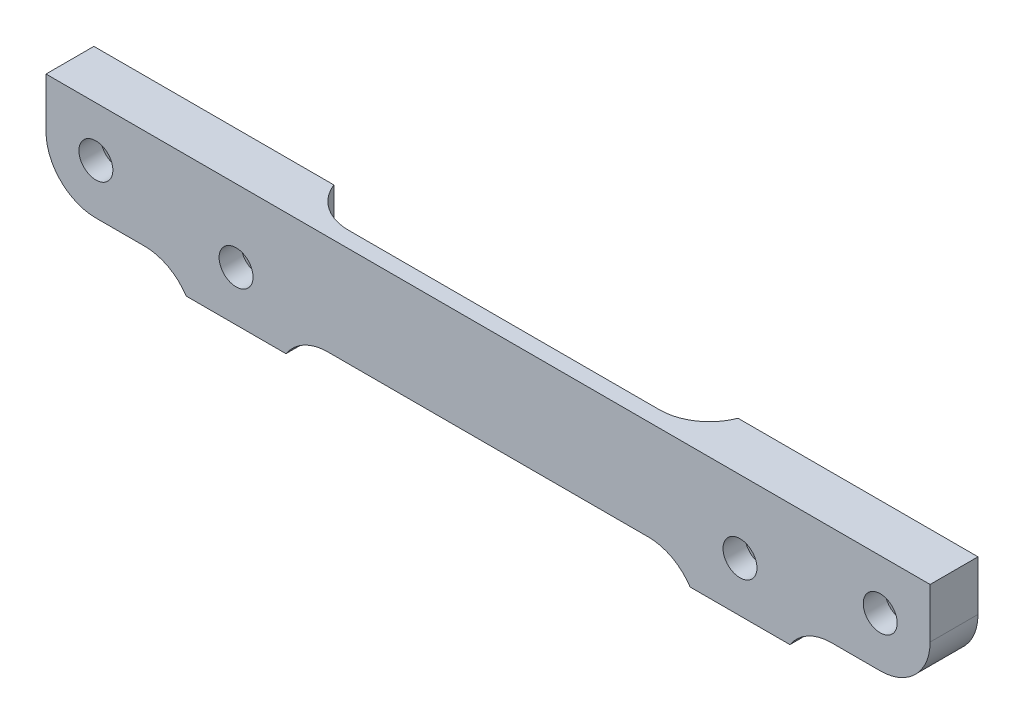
ISO-10303-21;
HEADER;
FILE_DESCRIPTION(('STEP AP214'),'2;1');
FILE_NAME('part.step','',(''),(''),'','','');
FILE_SCHEMA(('AUTOMOTIVE_DESIGN { 1 0 10303 214 1 1 1 1 }'));
ENDSEC;
DATA;
#1=APPLICATION_CONTEXT('core data for automotive mechanical design processes');
#2=APPLICATION_PROTOCOL_DEFINITION('international standard','automotive_design',2000,#1);
#3=PRODUCT_CONTEXT('',#1,'mechanical');
#4=PRODUCT('Part','Part','',(#3));
#5=PRODUCT_RELATED_PRODUCT_CATEGORY('part','',(#4));
#6=PRODUCT_DEFINITION_FORMATION('','',#4);
#7=PRODUCT_DEFINITION_CONTEXT('part definition',#1,'design');
#8=PRODUCT_DEFINITION('design','',#6,#7);
#9=PRODUCT_DEFINITION_SHAPE('','',#8);
#10=(LENGTH_UNIT() NAMED_UNIT(*) SI_UNIT(.MILLI.,.METRE.));
#11=(NAMED_UNIT(*) PLANE_ANGLE_UNIT() SI_UNIT($,.RADIAN.));
#12=(NAMED_UNIT(*) SI_UNIT($,.STERADIAN.) SOLID_ANGLE_UNIT());
#13=UNCERTAINTY_MEASURE_WITH_UNIT(LENGTH_MEASURE(1.E-05),#10,'distance_accuracy_value','');
#14=(GEOMETRIC_REPRESENTATION_CONTEXT(3) GLOBAL_UNCERTAINTY_ASSIGNED_CONTEXT((#13)) GLOBAL_UNIT_ASSIGNED_CONTEXT((#10,
#11,#12)) REPRESENTATION_CONTEXT('',''));
#15=CARTESIAN_POINT('',(0.,0.,0.));
#16=DIRECTION('',(0.,0.,1.));
#17=DIRECTION('',(1.,0.,0.));
#18=AXIS2_PLACEMENT_3D('',#15,#16,#17);
#19=CARTESIAN_POINT('',(67.6914723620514,-1.93358394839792,1.6));
#20=DIRECTION('',(0.,0.,-1.));
#21=DIRECTION('',(-1.,0.,0.));
#22=AXIS2_PLACEMENT_3D('',#19,#20,#21);
#23=CYLINDRICAL_SURFACE('',#22,1.7);
#24=CARTESIAN_POINT('',(67.6914723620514,-1.93358394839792,1.6));
#25=DIRECTION('',(0.,0.,1.));
#26=DIRECTION('',(1.,0.,0.));
#27=AXIS2_PLACEMENT_3D('',#24,#25,#26);
#28=CIRCLE('',#27,1.7);
#29=CARTESIAN_POINT('',(69.3914723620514,-1.93358394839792,1.6));
#30=VERTEX_POINT('',#29);
#31=EDGE_CURVE('E555',#30,#30,#28,.T.);
#32=ORIENTED_EDGE('',*,*,#31,.T.);
#33=EDGE_LOOP('',(#32));
#34=FACE_BOUND('',#33,.T.);
#35=CARTESIAN_POINT('',(67.6914723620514,-1.93358394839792,-0.600000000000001));
#36=DIRECTION('',(0.,0.,-1.));
#37=DIRECTION('',(-1.,0.,0.));
#38=AXIS2_PLACEMENT_3D('',#35,#36,#37);
#39=CIRCLE('',#38,1.7);
#40=CARTESIAN_POINT('',(65.9914723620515,-1.93358394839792,-0.600000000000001));
#41=VERTEX_POINT('',#40);
#42=EDGE_CURVE('E39',#41,#41,#39,.T.);
#43=ORIENTED_EDGE('',*,*,#42,.T.);
#44=EDGE_LOOP('',(#43));
#45=FACE_BOUND('',#44,.T.);
#46=ADVANCED_FACE('F35',(#34,#45),#23,.F.);
#47=CARTESIAN_POINT('',(3.14147236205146,-4.18358394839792,1.6));
#48=DIRECTION('',(0.,0.,-1.));
#49=DIRECTION('',(-1.,0.,0.));
#50=AXIS2_PLACEMENT_3D('',#47,#48,#49);
#51=CYLINDRICAL_SURFACE('',#50,1.7);
#52=CARTESIAN_POINT('',(3.14147236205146,-4.18358394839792,1.6));
#53=DIRECTION('',(0.,0.,1.));
#54=DIRECTION('',(1.,0.,0.));
#55=AXIS2_PLACEMENT_3D('',#52,#53,#54);
#56=CIRCLE('',#55,1.7);
#57=CARTESIAN_POINT('',(4.84147236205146,-4.18358394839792,1.6));
#58=VERTEX_POINT('',#57);
#59=EDGE_CURVE('E536',#58,#58,#56,.T.);
#60=ORIENTED_EDGE('',*,*,#59,.T.);
#61=EDGE_LOOP('',(#60));
#62=FACE_BOUND('',#61,.T.);
#63=CARTESIAN_POINT('',(3.14147236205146,-4.18358394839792,-0.600000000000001));
#64=DIRECTION('',(0.,0.,-1.));
#65=DIRECTION('',(-1.,0.,0.));
#66=AXIS2_PLACEMENT_3D('',#63,#64,#65);
#67=CIRCLE('',#66,1.7);
#68=CARTESIAN_POINT('',(1.44147236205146,-4.18358394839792,-0.600000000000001));
#69=VERTEX_POINT('',#68);
#70=EDGE_CURVE('E774',#69,#69,#67,.T.);
#71=ORIENTED_EDGE('',*,*,#70,.T.);
#72=EDGE_LOOP('',(#71));
#73=FACE_BOUND('',#72,.T.);
#74=ADVANCED_FACE('F681',(#62,#73),#51,.F.);
#75=CARTESIAN_POINT('',(53.6414723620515,-4.18358394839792,1.6));
#76=DIRECTION('',(0.,0.,-1.));
#77=DIRECTION('',(-1.,0.,0.));
#78=AXIS2_PLACEMENT_3D('',#75,#76,#77);
#79=CYLINDRICAL_SURFACE('',#78,1.7);
#80=CARTESIAN_POINT('',(53.6414723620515,-4.18358394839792,1.6));
#81=DIRECTION('',(0.,0.,1.));
#82=DIRECTION('',(1.,0.,0.));
#83=AXIS2_PLACEMENT_3D('',#80,#81,#82);
#84=CIRCLE('',#83,1.7);
#85=CARTESIAN_POINT('',(55.3414723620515,-4.18358394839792,1.6));
#86=VERTEX_POINT('',#85);
#87=EDGE_CURVE('E533',#86,#86,#84,.T.);
#88=ORIENTED_EDGE('',*,*,#87,.T.);
#89=EDGE_LOOP('',(#88));
#90=FACE_BOUND('',#89,.T.);
#91=CARTESIAN_POINT('',(53.6414723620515,-4.18358394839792,-0.600000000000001));
#92=DIRECTION('',(0.,0.,-1.));
#93=DIRECTION('',(-1.,0.,0.));
#94=AXIS2_PLACEMENT_3D('',#91,#92,#93);
#95=CIRCLE('',#94,1.7);
#96=CARTESIAN_POINT('',(51.9414723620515,-4.18358394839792,-0.600000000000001));
#97=VERTEX_POINT('',#96);
#98=EDGE_CURVE('E353',#97,#97,#95,.T.);
#99=ORIENTED_EDGE('',*,*,#98,.T.);
#100=EDGE_LOOP('',(#99));
#101=FACE_BOUND('',#100,.T.);
#102=ADVANCED_FACE('F688',(#90,#101),#79,.F.);
#103=CARTESIAN_POINT('',(-10.9085276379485,-1.93358394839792,1.6));
#104=DIRECTION('',(0.,0.,-1.));
#105=DIRECTION('',(-1.,0.,0.));
#106=AXIS2_PLACEMENT_3D('',#103,#104,#105);
#107=CYLINDRICAL_SURFACE('',#106,1.7);
#108=CARTESIAN_POINT('',(-10.9085276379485,-1.93358394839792,1.6));
#109=DIRECTION('',(0.,0.,1.));
#110=DIRECTION('',(1.,0.,0.));
#111=AXIS2_PLACEMENT_3D('',#108,#109,#110);
#112=CIRCLE('',#111,1.7);
#113=CARTESIAN_POINT('',(-9.20852763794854,-1.93358394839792,1.6));
#114=VERTEX_POINT('',#113);
#115=EDGE_CURVE('E558',#114,#114,#112,.T.);
#116=ORIENTED_EDGE('',*,*,#115,.T.);
#117=EDGE_LOOP('',(#116));
#118=FACE_BOUND('',#117,.T.);
#119=CARTESIAN_POINT('',(-10.9085276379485,-1.93358394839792,-0.600000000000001));
#120=DIRECTION('',(0.,0.,-1.));
#121=DIRECTION('',(-1.,0.,0.));
#122=AXIS2_PLACEMENT_3D('',#119,#120,#121);
#123=CIRCLE('',#122,1.7);
#124=CARTESIAN_POINT('',(-12.6085276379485,-1.93358394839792,-0.600000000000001));
#125=VERTEX_POINT('',#124);
#126=EDGE_CURVE('E492',#125,#125,#123,.T.);
#127=ORIENTED_EDGE('',*,*,#126,.T.);
#128=EDGE_LOOP('',(#127));
#129=FACE_BOUND('',#128,.T.);
#130=ADVANCED_FACE('F610',(#118,#129),#107,.F.);
#131=CARTESIAN_POINT('',(-15.9085276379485,-6.93358394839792,1.6));
#132=DIRECTION('',(0.,1.,0.));
#133=DIRECTION('',(0.,0.,1.));
#134=AXIS2_PLACEMENT_3D('',#131,#132,#133);
#135=PLANE('',#134);
#136=DIRECTION('',(1.,0.,0.));
#137=VECTOR('',#136,1.);
#138=CARTESIAN_POINT('',(-15.9085276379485,-6.93358394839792,0.));
#139=LINE('',#138,#137);
#140=CARTESIAN_POINT('',(12.8062338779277,-6.93358394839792,0.));
#141=VERTEX_POINT('',#140);
#142=CARTESIAN_POINT('',(43.9767108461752,-6.93358394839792,0.));
#143=VERTEX_POINT('',#142);
#144=EDGE_CURVE('E561',#141,#143,#139,.T.);
#145=ORIENTED_EDGE('',*,*,#144,.T.);
#146=CARTESIAN_POINT('',(43.9767108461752,-6.93358394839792,-5.));
#147=DIRECTION('',(0.,1.,0.));
#148=DIRECTION('',(0.,0.,1.));
#149=AXIS2_PLACEMENT_3D('',#146,#147,#148);
#150=CIRCLE('',#149,5.);
#151=CARTESIAN_POINT('',(44.465649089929,-6.93358394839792,-0.0239634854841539));
#152=VERTEX_POINT('',#151);
#153=EDGE_CURVE('E738',#143,#152,#150,.T.);
#154=ORIENTED_EDGE('',*,*,#153,.T.);
#155=CARTESIAN_POINT('',(44.465649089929,-6.93358394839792,-0.0239634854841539));
#156=CARTESIAN_POINT('',(44.465649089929,-6.93358394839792,0.));
#157=B_SPLINE_CURVE_WITH_KNOTS('',1,(#155,#156),.UNSPECIFIED.,.F.,.F.,(2,2),(0.,1.),.UNSPECIFIED.);
#158=CARTESIAN_POINT('',(44.465649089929,-6.93358394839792,0.));
#159=VERTEX_POINT('',#158);
#160=EDGE_CURVE('E593',#152,#159,#157,.T.);
#161=ORIENTED_EDGE('',*,*,#160,.T.);
#162=DIRECTION('',(0.,0.,1.));
#163=VECTOR('',#162,1.);
#164=CARTESIAN_POINT('',(44.465649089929,-6.93358394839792,1.6));
#165=LINE('',#164,#163);
#166=CARTESIAN_POINT('',(44.465649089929,-6.93358394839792,1.6));
#167=VERTEX_POINT('',#166);
#168=EDGE_CURVE('E587',#159,#167,#165,.T.);
#169=ORIENTED_EDGE('',*,*,#168,.T.);
#170=DIRECTION('',(1.,0.,0.));
#171=VECTOR('',#170,1.);
#172=CARTESIAN_POINT('',(-15.9085276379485,-6.93358394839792,1.6));
#173=LINE('',#172,#171);
#174=CARTESIAN_POINT('',(12.317295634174,-6.93358394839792,1.6));
#175=VERTEX_POINT('',#174);
#176=EDGE_CURVE('E569',#175,#167,#173,.T.);
#177=ORIENTED_EDGE('',*,*,#176,.F.);
#178=DIRECTION('',(0.,0.,-1.));
#179=VECTOR('',#178,1.);
#180=CARTESIAN_POINT('',(12.317295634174,-6.93358394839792,1.6));
#181=LINE('',#180,#179);
#182=CARTESIAN_POINT('',(12.317295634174,-6.93358394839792,0.));
#183=VERTEX_POINT('',#182);
#184=EDGE_CURVE('E584',#175,#183,#181,.T.);
#185=ORIENTED_EDGE('',*,*,#184,.T.);
#186=CARTESIAN_POINT('',(12.317295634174,-6.93358394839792,0.));
#187=CARTESIAN_POINT('',(12.317295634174,-6.93358394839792,-0.023963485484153));
#188=B_SPLINE_CURVE_WITH_KNOTS('',1,(#186,#187),.UNSPECIFIED.,.F.,.F.,(2,2),(0.,1.),.UNSPECIFIED.);
#189=CARTESIAN_POINT('',(12.317295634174,-6.93358394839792,-0.023963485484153));
#190=VERTEX_POINT('',#189);
#191=EDGE_CURVE('E619',#183,#190,#188,.T.);
#192=ORIENTED_EDGE('',*,*,#191,.T.);
#193=CARTESIAN_POINT('',(12.8062338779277,-6.93358394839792,-5.));
#194=DIRECTION('',(0.,1.,0.));
#195=DIRECTION('',(0.,0.,1.));
#196=AXIS2_PLACEMENT_3D('',#193,#194,#195);
#197=CIRCLE('',#196,5.);
#198=EDGE_CURVE('E633',#190,#141,#197,.T.);
#199=ORIENTED_EDGE('',*,*,#198,.T.);
#200=EDGE_LOOP('',(#145,#154,#161,#169,#177,#185,#192,#199));
#201=FACE_BOUND('',#200,.T.);
#202=ADVANCED_FACE('F599',(#201),#135,.F.);
#203=DIRECTION('',(1.,0.,0.));
#204=VECTOR('',#203,1.);
#205=CARTESIAN_POINT('',(72.6914723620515,-6.93358394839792,-3.2));
#206=LINE('',#205,#204);
#207=CARTESIAN_POINT('',(62.817295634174,-6.93358394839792,-3.2));
#208=VERTEX_POINT('',#207);
#209=CARTESIAN_POINT('',(67.6914723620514,-6.93358394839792,-3.2));
#210=VERTEX_POINT('',#209);
#211=EDGE_CURVE('E515',#208,#210,#206,.T.);
#212=ORIENTED_EDGE('',*,*,#211,.T.);
#213=DIRECTION('',(0.,0.,-1.));
#214=VECTOR('',#213,1.);
#215=CARTESIAN_POINT('',(67.6914723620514,-6.93358394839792,1.6));
#216=LINE('',#215,#214);
#217=CARTESIAN_POINT('',(67.6914723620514,-6.93358394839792,1.6));
#218=VERTEX_POINT('',#217);
#219=EDGE_CURVE('E1312',#210,#218,#216,.F.);
#220=ORIENTED_EDGE('',*,*,#219,.T.);
#221=CARTESIAN_POINT('',(62.817295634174,-6.93358394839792,1.6));
#222=VERTEX_POINT('',#221);
#223=EDGE_CURVE('E565',#222,#218,#173,.T.);
#224=ORIENTED_EDGE('',*,*,#223,.F.);
#225=DIRECTION('',(0.,0.,-1.));
#226=VECTOR('',#225,1.);
#227=CARTESIAN_POINT('',(62.817295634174,-6.93358394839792,1.6));
#228=LINE('',#227,#226);
#229=EDGE_CURVE('E1309',#222,#208,#228,.T.);
#230=ORIENTED_EDGE('',*,*,#229,.T.);
#231=EDGE_LOOP('',(#212,#220,#224,#230));
#232=FACE_BOUND('',#231,.T.);
#233=ADVANCED_FACE('F609',(#232),#135,.F.);
#234=CARTESIAN_POINT('',(-10.9085276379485,-6.93358394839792,1.6));
#235=VERTEX_POINT('',#234);
#236=CARTESIAN_POINT('',(-6.03435091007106,-6.93358394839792,1.6));
#237=VERTEX_POINT('',#236);
#238=EDGE_CURVE('E570',#235,#237,#173,.T.);
#239=ORIENTED_EDGE('',*,*,#238,.F.);
#240=DIRECTION('',(0.,0.,-1.));
#241=VECTOR('',#240,1.);
#242=CARTESIAN_POINT('',(-10.9085276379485,-6.93358394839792,1.6));
#243=LINE('',#242,#241);
#244=CARTESIAN_POINT('',(-10.9085276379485,-6.93358394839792,-3.2));
#245=VERTEX_POINT('',#244);
#246=EDGE_CURVE('E1299',#235,#245,#243,.T.);
#247=ORIENTED_EDGE('',*,*,#246,.T.);
#248=DIRECTION('',(1.,0.,0.));
#249=VECTOR('',#248,1.);
#250=CARTESIAN_POINT('',(-15.9085276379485,-6.93358394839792,-3.2));
#251=LINE('',#250,#249);
#252=CARTESIAN_POINT('',(-6.03435091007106,-6.93358394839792,-3.2));
#253=VERTEX_POINT('',#252);
#254=EDGE_CURVE('E521',#245,#253,#251,.T.);
#255=ORIENTED_EDGE('',*,*,#254,.T.);
#256=DIRECTION('',(0.,0.,1.));
#257=VECTOR('',#256,1.);
#258=CARTESIAN_POINT('',(-6.03435091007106,-6.93358394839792,1.6));
#259=LINE('',#258,#257);
#260=EDGE_CURVE('E635',#253,#237,#259,.T.);
#261=ORIENTED_EDGE('',*,*,#260,.T.);
#262=EDGE_LOOP('',(#239,#247,#255,#261));
#263=FACE_BOUND('',#262,.T.);
#264=ADVANCED_FACE('F612',(#263),#135,.F.);
#265=CARTESIAN_POINT('',(0.,0.,1.6));
#266=DIRECTION('',(0.,0.,1.));
#267=DIRECTION('',(1.,0.,0.));
#268=AXIS2_PLACEMENT_3D('',#265,#266,#267);
#269=PLANE('',#268);
#270=ORIENTED_EDGE('',*,*,#87,.F.);
#271=EDGE_LOOP('',(#270));
#272=FACE_BOUND('',#271,.T.);
#273=ORIENTED_EDGE('',*,*,#59,.F.);
#274=EDGE_LOOP('',(#273));
#275=FACE_BOUND('',#274,.T.);
#276=ORIENTED_EDGE('',*,*,#115,.F.);
#277=EDGE_LOOP('',(#276));
#278=FACE_BOUND('',#277,.T.);
#279=DIRECTION('',(0.,-1.,0.));
#280=VECTOR('',#279,1.);
#281=CARTESIAN_POINT('',(-15.9085276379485,3.06641605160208,1.6));
#282=LINE('',#281,#280);
#283=CARTESIAN_POINT('',(-15.9085276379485,3.06641605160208,1.6));
#284=VERTEX_POINT('',#283);
#285=CARTESIAN_POINT('',(-15.9085276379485,-1.93358394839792,1.6));
#286=VERTEX_POINT('',#285);
#287=EDGE_CURVE('E562',#284,#286,#282,.T.);
#288=ORIENTED_EDGE('',*,*,#287,.T.);
#289=CARTESIAN_POINT('',(-10.9085276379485,-1.93358394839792,1.6));
#290=DIRECTION('',(0.,0.,1.));
#291=DIRECTION('',(1.,0.,0.));
#292=AXIS2_PLACEMENT_3D('',#289,#290,#291);
#293=CIRCLE('',#292,5.);
#294=EDGE_CURVE('E749',#286,#235,#293,.T.);
#295=ORIENTED_EDGE('',*,*,#294,.T.);
#296=ORIENTED_EDGE('',*,*,#238,.T.);
#297=CARTESIAN_POINT('',(-6.03435091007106,-11.9335839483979,1.6));
#298=DIRECTION('',(0.,0.,1.));
#299=DIRECTION('',(1.,0.,0.));
#300=AXIS2_PLACEMENT_3D('',#297,#298,#299);
#301=CIRCLE('',#300,5.);
#302=CARTESIAN_POINT('',(-1.85852763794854,-9.18358394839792,1.6));
#303=VERTEX_POINT('',#302);
#304=EDGE_CURVE('E11',#237,#303,#301,.F.);
#305=ORIENTED_EDGE('',*,*,#304,.T.);
#306=DIRECTION('',(1.,0.,0.));
#307=VECTOR('',#306,1.);
#308=CARTESIAN_POINT('',(-1.85852763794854,-9.18358394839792,1.6));
#309=LINE('',#308,#307);
#310=CARTESIAN_POINT('',(8.14147236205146,-9.18358394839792,1.6));
#311=VERTEX_POINT('',#310);
#312=EDGE_CURVE('E547',#303,#311,#309,.T.);
#313=ORIENTED_EDGE('',*,*,#312,.T.);
#314=CARTESIAN_POINT('',(12.317295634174,-11.9335839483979,1.6));
#315=DIRECTION('',(0.,0.,1.));
#316=DIRECTION('',(1.,0.,0.));
#317=AXIS2_PLACEMENT_3D('',#314,#315,#316);
#318=CIRCLE('',#317,5.);
#319=EDGE_CURVE('E623',#311,#175,#318,.F.);
#320=ORIENTED_EDGE('',*,*,#319,.T.);
#321=ORIENTED_EDGE('',*,*,#176,.T.);
#322=CARTESIAN_POINT('',(44.465649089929,-11.9335839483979,1.6));
#323=DIRECTION('',(0.,0.,1.));
#324=DIRECTION('',(1.,0.,0.));
#325=AXIS2_PLACEMENT_3D('',#322,#323,#324);
#326=CIRCLE('',#325,5.);
#327=CARTESIAN_POINT('',(48.6414723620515,-9.18358394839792,1.6));
#328=VERTEX_POINT('',#327);
#329=EDGE_CURVE('E597',#167,#328,#326,.F.);
#330=ORIENTED_EDGE('',*,*,#329,.T.);
#331=DIRECTION('',(1.,0.,0.));
#332=VECTOR('',#331,1.);
#333=CARTESIAN_POINT('',(48.6414723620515,-9.18358394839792,1.6));
#334=LINE('',#333,#332);
#335=CARTESIAN_POINT('',(58.6414723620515,-9.18358394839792,1.6));
#336=VERTEX_POINT('',#335);
#337=EDGE_CURVE('E539',#328,#336,#334,.T.);
#338=ORIENTED_EDGE('',*,*,#337,.T.);
#339=CARTESIAN_POINT('',(62.817295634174,-11.9335839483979,1.6));
#340=DIRECTION('',(0.,0.,1.));
#341=DIRECTION('',(1.,0.,0.));
#342=AXIS2_PLACEMENT_3D('',#339,#340,#341);
#343=CIRCLE('',#342,5.);
#344=EDGE_CURVE('E1316',#336,#222,#343,.F.);
#345=ORIENTED_EDGE('',*,*,#344,.T.);
#346=ORIENTED_EDGE('',*,*,#223,.T.);
#347=CARTESIAN_POINT('',(67.6914723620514,-1.93358394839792,1.6));
#348=DIRECTION('',(0.,0.,1.));
#349=DIRECTION('',(1.,0.,0.));
#350=AXIS2_PLACEMENT_3D('',#347,#348,#349);
#351=CIRCLE('',#350,5.);
#352=CARTESIAN_POINT('',(72.6914723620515,-1.93358394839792,1.6));
#353=VERTEX_POINT('',#352);
#354=EDGE_CURVE('E1296',#218,#353,#351,.T.);
#355=ORIENTED_EDGE('',*,*,#354,.T.);
#356=DIRECTION('',(0.,1.,0.));
#357=VECTOR('',#356,1.);
#358=CARTESIAN_POINT('',(72.6914723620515,3.06641605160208,1.6));
#359=LINE('',#358,#357);
#360=CARTESIAN_POINT('',(72.6914723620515,3.06641605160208,1.6));
#361=VERTEX_POINT('',#360);
#362=EDGE_CURVE('E571',#353,#361,#359,.T.);
#363=ORIENTED_EDGE('',*,*,#362,.T.);
#364=DIRECTION('',(-1.,0.,0.));
#365=VECTOR('',#364,1.);
#366=CARTESIAN_POINT('',(-15.9085276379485,3.06641605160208,1.6));
#367=LINE('',#366,#365);
#368=EDGE_CURVE('E573',#361,#284,#367,.T.);
#369=ORIENTED_EDGE('',*,*,#368,.T.);
#370=EDGE_LOOP('',(#288,#295,#296,#305,#313,#320,#321,#330,#338,#345,#346,#355,#363,#369));
#371=FACE_BOUND('',#370,.T.);
#372=ORIENTED_EDGE('',*,*,#31,.F.);
#373=EDGE_LOOP('',(#372));
#374=FACE_BOUND('',#373,.T.);
#375=ADVANCED_FACE('F699',(#272,#275,#278,#371,#374),#269,.T.);
#376=CARTESIAN_POINT('',(0.,0.,0.));
#377=DIRECTION('',(0.,0.,1.));
#378=DIRECTION('',(1.,0.,0.));
#379=AXIS2_PLACEMENT_3D('',#376,#377,#378);
#380=PLANE('',#379);
#381=DIRECTION('',(-1.,0.,0.));
#382=VECTOR('',#381,1.);
#383=CARTESIAN_POINT('',(-15.9085276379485,3.06641605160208,0.));
#384=LINE('',#383,#382);
#385=CARTESIAN_POINT('',(43.9767108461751,3.06641605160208,0.));
#386=VERTEX_POINT('',#385);
#387=CARTESIAN_POINT('',(12.8062338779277,3.06641605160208,0.));
#388=VERTEX_POINT('',#387);
#389=EDGE_CURVE('E566',#386,#388,#384,.T.);
#390=ORIENTED_EDGE('',*,*,#389,.F.);
#391=DIRECTION('',(0.,1.,0.));
#392=VECTOR('',#391,1.);
#393=CARTESIAN_POINT('',(43.9767108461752,2.7124420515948E-13,0.));
#394=LINE('',#393,#392);
#395=EDGE_CURVE('E591',#386,#143,#394,.F.);
#396=ORIENTED_EDGE('',*,*,#395,.T.);
#397=ORIENTED_EDGE('',*,*,#144,.F.);
#398=DIRECTION('',(0.,1.,0.));
#399=VECTOR('',#398,1.);
#400=CARTESIAN_POINT('',(12.8062338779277,0.,0.));
#401=LINE('',#400,#399);
#402=EDGE_CURVE('E589',#141,#388,#401,.T.);
#403=ORIENTED_EDGE('',*,*,#402,.T.);
#404=EDGE_LOOP('',(#390,#396,#397,#403));
#405=FACE_BOUND('',#404,.T.);
#406=ADVANCED_FACE('F702',(#405),#380,.F.);
#407=CARTESIAN_POINT('',(-15.9085276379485,3.06641605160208,1.6));
#408=DIRECTION('',(1.,0.,0.));
#409=DIRECTION('',(0.,0.,-1.));
#410=AXIS2_PLACEMENT_3D('',#407,#408,#409);
#411=PLANE('',#410);
#412=DIRECTION('',(0.,-1.,0.));
#413=VECTOR('',#412,1.);
#414=CARTESIAN_POINT('',(-15.9085276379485,3.06641605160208,-3.2));
#415=LINE('',#414,#413);
#416=CARTESIAN_POINT('',(-15.9085276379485,3.06641605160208,-3.2));
#417=VERTEX_POINT('',#416);
#418=CARTESIAN_POINT('',(-15.9085276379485,-1.93358394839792,-3.2));
#419=VERTEX_POINT('',#418);
#420=EDGE_CURVE('E518',#417,#419,#415,.T.);
#421=ORIENTED_EDGE('',*,*,#420,.T.);
#422=DIRECTION('',(0.,0.,-1.));
#423=VECTOR('',#422,1.);
#424=CARTESIAN_POINT('',(-15.9085276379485,-1.93358394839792,1.6));
#425=LINE('',#424,#423);
#426=EDGE_CURVE('E1294',#419,#286,#425,.F.);
#427=ORIENTED_EDGE('',*,*,#426,.T.);
#428=ORIENTED_EDGE('',*,*,#287,.F.);
#429=DIRECTION('',(0.,0.,-1.));
#430=VECTOR('',#429,1.);
#431=CARTESIAN_POINT('',(-15.9085276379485,3.06641605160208,1.6));
#432=LINE('',#431,#430);
#433=EDGE_CURVE('E575',#284,#417,#432,.T.);
#434=ORIENTED_EDGE('',*,*,#433,.T.);
#435=EDGE_LOOP('',(#421,#427,#428,#434));
#436=FACE_BOUND('',#435,.T.);
#437=ADVANCED_FACE('F615',(#436),#411,.F.);
#438=CARTESIAN_POINT('',(72.6914723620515,3.06641605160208,1.6));
#439=DIRECTION('',(-1.,0.,0.));
#440=DIRECTION('',(0.,0.,1.));
#441=AXIS2_PLACEMENT_3D('',#438,#439,#440);
#442=PLANE('',#441);
#443=ORIENTED_EDGE('',*,*,#362,.F.);
#444=DIRECTION('',(0.,0.,-1.));
#445=VECTOR('',#444,1.);
#446=CARTESIAN_POINT('',(72.6914723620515,-1.93358394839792,1.6));
#447=LINE('',#446,#445);
#448=CARTESIAN_POINT('',(72.6914723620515,-1.93358394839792,-3.2));
#449=VERTEX_POINT('',#448);
#450=EDGE_CURVE('E1304',#353,#449,#447,.T.);
#451=ORIENTED_EDGE('',*,*,#450,.T.);
#452=DIRECTION('',(0.,1.,0.));
#453=VECTOR('',#452,1.);
#454=CARTESIAN_POINT('',(72.6914723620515,3.06641605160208,-3.2));
#455=LINE('',#454,#453);
#456=CARTESIAN_POINT('',(72.6914723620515,3.06641605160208,-3.2));
#457=VERTEX_POINT('',#456);
#458=EDGE_CURVE('E503',#449,#457,#455,.T.);
#459=ORIENTED_EDGE('',*,*,#458,.T.);
#460=DIRECTION('',(0.,0.,-1.));
#461=VECTOR('',#460,1.);
#462=CARTESIAN_POINT('',(72.6914723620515,3.06641605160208,1.6));
#463=LINE('',#462,#461);
#464=EDGE_CURVE('E581',#361,#457,#463,.T.);
#465=ORIENTED_EDGE('',*,*,#464,.F.);
#466=EDGE_LOOP('',(#443,#451,#459,#465));
#467=FACE_BOUND('',#466,.T.);
#468=ADVANCED_FACE('F613',(#467),#442,.F.);
#469=CARTESIAN_POINT('',(-15.9085276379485,3.06641605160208,1.6));
#470=DIRECTION('',(0.,-1.,0.));
#471=DIRECTION('',(0.,0.,-1.));
#472=AXIS2_PLACEMENT_3D('',#469,#470,#471);
#473=PLANE('',#472);
#474=ORIENTED_EDGE('',*,*,#464,.T.);
#475=DIRECTION('',(-1.,0.,0.));
#476=VECTOR('',#475,1.);
#477=CARTESIAN_POINT('',(48.6414723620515,3.06641605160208,-3.2));
#478=LINE('',#477,#476);
#479=CARTESIAN_POINT('',(48.6414723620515,3.06641605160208,-3.2));
#480=VERTEX_POINT('',#479);
#481=EDGE_CURVE('E505',#457,#480,#478,.T.);
#482=ORIENTED_EDGE('',*,*,#481,.T.);
#483=CARTESIAN_POINT('',(43.9767108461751,3.06641605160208,-5.));
#484=DIRECTION('',(0.,-1.,0.));
#485=DIRECTION('',(0.,0.,-1.));
#486=AXIS2_PLACEMENT_3D('',#483,#484,#485);
#487=CIRCLE('',#486,5.);
#488=EDGE_CURVE('E624',#480,#386,#487,.T.);
#489=ORIENTED_EDGE('',*,*,#488,.T.);
#490=ORIENTED_EDGE('',*,*,#389,.T.);
#491=CARTESIAN_POINT('',(12.8062338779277,3.06641605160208,-5.));
#492=DIRECTION('',(0.,-1.,0.));
#493=DIRECTION('',(0.,0.,-1.));
#494=AXIS2_PLACEMENT_3D('',#491,#492,#493);
#495=CIRCLE('',#494,5.);
#496=CARTESIAN_POINT('',(8.14147236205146,3.06641605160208,-3.2));
#497=VERTEX_POINT('',#496);
#498=EDGE_CURVE('E631',#388,#497,#495,.T.);
#499=ORIENTED_EDGE('',*,*,#498,.T.);
#500=DIRECTION('',(-1.,0.,0.));
#501=VECTOR('',#500,1.);
#502=CARTESIAN_POINT('',(-15.9085276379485,3.06641605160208,-3.2));
#503=LINE('',#502,#501);
#504=EDGE_CURVE('E530',#497,#417,#503,.T.);
#505=ORIENTED_EDGE('',*,*,#504,.T.);
#506=ORIENTED_EDGE('',*,*,#433,.F.);
#507=ORIENTED_EDGE('',*,*,#368,.F.);
#508=EDGE_LOOP('',(#474,#482,#489,#490,#499,#505,#506,#507));
#509=FACE_BOUND('',#508,.T.);
#510=ADVANCED_FACE('F706',(#509),#473,.F.);
#511=CARTESIAN_POINT('',(-1.85852763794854,-9.18358394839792,1.6));
#512=DIRECTION('',(0.,1.,0.));
#513=DIRECTION('',(0.,0.,1.));
#514=AXIS2_PLACEMENT_3D('',#511,#512,#513);
#515=PLANE('',#514);
#516=DIRECTION('',(0.,0.,-1.));
#517=VECTOR('',#516,1.);
#518=CARTESIAN_POINT('',(-1.85852763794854,-9.18358394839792,1.6));
#519=LINE('',#518,#517);
#520=CARTESIAN_POINT('',(-1.85852763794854,-9.18358394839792,-3.2));
#521=VERTEX_POINT('',#520);
#522=EDGE_CURVE('E552',#303,#521,#519,.T.);
#523=ORIENTED_EDGE('',*,*,#522,.T.);
#524=DIRECTION('',(1.,0.,0.));
#525=VECTOR('',#524,1.);
#526=CARTESIAN_POINT('',(-1.85852763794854,-9.18358394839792,-3.2));
#527=LINE('',#526,#525);
#528=CARTESIAN_POINT('',(8.14147236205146,-9.18358394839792,-3.2));
#529=VERTEX_POINT('',#528);
#530=EDGE_CURVE('E524',#521,#529,#527,.T.);
#531=ORIENTED_EDGE('',*,*,#530,.T.);
#532=DIRECTION('',(0.,0.,-1.));
#533=VECTOR('',#532,1.);
#534=CARTESIAN_POINT('',(8.14147236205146,-9.18358394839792,1.6));
#535=LINE('',#534,#533);
#536=EDGE_CURVE('E549',#311,#529,#535,.T.);
#537=ORIENTED_EDGE('',*,*,#536,.F.);
#538=ORIENTED_EDGE('',*,*,#312,.F.);
#539=EDGE_LOOP('',(#523,#531,#537,#538));
#540=FACE_BOUND('',#539,.T.);
#541=ADVANCED_FACE('F694',(#540),#515,.F.);
#542=CARTESIAN_POINT('',(48.6414723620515,-9.18358394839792,1.6));
#543=DIRECTION('',(0.,1.,0.));
#544=DIRECTION('',(0.,0.,1.));
#545=AXIS2_PLACEMENT_3D('',#542,#543,#544);
#546=PLANE('',#545);
#547=DIRECTION('',(0.,0.,-1.));
#548=VECTOR('',#547,1.);
#549=CARTESIAN_POINT('',(48.6414723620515,-9.18358394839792,1.6));
#550=LINE('',#549,#548);
#551=CARTESIAN_POINT('',(48.6414723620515,-9.18358394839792,-3.2));
#552=VERTEX_POINT('',#551);
#553=EDGE_CURVE('E544',#328,#552,#550,.T.);
#554=ORIENTED_EDGE('',*,*,#553,.T.);
#555=DIRECTION('',(1.,0.,0.));
#556=VECTOR('',#555,1.);
#557=CARTESIAN_POINT('',(58.6414723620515,-9.18358394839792,-3.2));
#558=LINE('',#557,#556);
#559=CARTESIAN_POINT('',(58.6414723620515,-9.18358394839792,-3.2));
#560=VERTEX_POINT('',#559);
#561=EDGE_CURVE('E512',#552,#560,#558,.T.);
#562=ORIENTED_EDGE('',*,*,#561,.T.);
#563=DIRECTION('',(0.,0.,-1.));
#564=VECTOR('',#563,1.);
#565=CARTESIAN_POINT('',(58.6414723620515,-9.18358394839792,1.6));
#566=LINE('',#565,#564);
#567=EDGE_CURVE('E541',#336,#560,#566,.T.);
#568=ORIENTED_EDGE('',*,*,#567,.F.);
#569=ORIENTED_EDGE('',*,*,#337,.F.);
#570=EDGE_LOOP('',(#554,#562,#568,#569));
#571=FACE_BOUND('',#570,.T.);
#572=ADVANCED_FACE('F713',(#571),#546,.F.);
#573=CARTESIAN_POINT('',(0.,0.,-3.2));
#574=DIRECTION('',(0.,0.,1.));
#575=DIRECTION('',(1.,0.,0.));
#576=AXIS2_PLACEMENT_3D('',#573,#574,#575);
#577=PLANE('',#576);
#578=DIRECTION('',(-0.5,-0.866025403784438,0.));
#579=VECTOR('',#578,1.);
#580=CARTESIAN_POINT('',(6.37463386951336,-4.18358394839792,-3.2));
#581=LINE('',#580,#579);
#582=CARTESIAN_POINT('',(6.37463386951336,-4.18358394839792,-3.2));
#583=VERTEX_POINT('',#582);
#584=CARTESIAN_POINT('',(4.75805311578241,-6.98358394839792,-3.2));
#585=VERTEX_POINT('',#584);
#586=EDGE_CURVE('E340',#583,#585,#581,.T.);
#587=ORIENTED_EDGE('',*,*,#586,.F.);
#588=DIRECTION('',(0.5,-0.866025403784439,0.));
#589=VECTOR('',#588,1.);
#590=CARTESIAN_POINT('',(4.75805311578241,-1.38358394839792,-3.2));
#591=LINE('',#590,#589);
#592=CARTESIAN_POINT('',(4.75805311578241,-1.38358394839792,-3.2));
#593=VERTEX_POINT('',#592);
#594=EDGE_CURVE('E52',#593,#583,#591,.T.);
#595=ORIENTED_EDGE('',*,*,#594,.F.);
#596=DIRECTION('',(1.,0.,0.));
#597=VECTOR('',#596,1.);
#598=CARTESIAN_POINT('',(1.5248916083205,-1.38358394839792,-3.2));
#599=LINE('',#598,#597);
#600=CARTESIAN_POINT('',(1.5248916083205,-1.38358394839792,-3.2));
#601=VERTEX_POINT('',#600);
#602=EDGE_CURVE('E326',#601,#593,#599,.T.);
#603=ORIENTED_EDGE('',*,*,#602,.F.);
#604=DIRECTION('',(0.5,0.866025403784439,0.));
#605=VECTOR('',#604,1.);
#606=CARTESIAN_POINT('',(-0.0916891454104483,-4.18358394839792,-3.2));
#607=LINE('',#606,#605);
#608=CARTESIAN_POINT('',(-0.0916891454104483,-4.18358394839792,-3.2));
#609=VERTEX_POINT('',#608);
#610=EDGE_CURVE('E329',#609,#601,#607,.T.);
#611=ORIENTED_EDGE('',*,*,#610,.F.);
#612=DIRECTION('',(-0.5,0.866025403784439,0.));
#613=VECTOR('',#612,1.);
#614=CARTESIAN_POINT('',(1.5248916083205,-6.98358394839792,-3.2));
#615=LINE('',#614,#613);
#616=CARTESIAN_POINT('',(1.5248916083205,-6.98358394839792,-3.2));
#617=VERTEX_POINT('',#616);
#618=EDGE_CURVE('E346',#617,#609,#615,.T.);
#619=ORIENTED_EDGE('',*,*,#618,.F.);
#620=DIRECTION('',(-1.,0.,0.));
#621=VECTOR('',#620,1.);
#622=CARTESIAN_POINT('',(4.75805311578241,-6.98358394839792,-3.2));
#623=LINE('',#622,#621);
#624=EDGE_CURVE('E343',#585,#617,#623,.T.);
#625=ORIENTED_EDGE('',*,*,#624,.F.);
#626=EDGE_LOOP('',(#587,#595,#603,#611,#619,#625));
#627=FACE_BOUND('',#626,.T.);
#628=DIRECTION('',(0.494534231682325,-0.869158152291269,0.));
#629=VECTOR('',#628,1.);
#630=CARTESIAN_POINT('',(-9.27433933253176,0.856176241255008,-3.2));
#631=LINE('',#630,#629);
#632=CARTESIAN_POINT('',(-9.27433933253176,0.856176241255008,-3.2));
#633=VERTEX_POINT('',#632);
#634=CARTESIAN_POINT('',(-7.67543029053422,-1.95395244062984,-3.2));
#635=VERTEX_POINT('',#634);
#636=EDGE_CURVE('E476',#633,#635,#631,.T.);
#637=ORIENTED_EDGE('',*,*,#636,.F.);
#638=DIRECTION('',(0.999980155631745,-0.00629986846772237,0.));
#639=VECTOR('',#638,1.);
#640=CARTESIAN_POINT('',(-12.5074366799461,0.876544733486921,-3.2));
#641=LINE('',#640,#639);
#642=CARTESIAN_POINT('',(-12.5074366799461,0.876544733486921,-3.2));
#643=VERTEX_POINT('',#642);
#644=EDGE_CURVE('E474',#643,#633,#641,.T.);
#645=ORIENTED_EDGE('',*,*,#644,.F.);
#646=DIRECTION('',(0.505445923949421,0.862858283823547,0.));
#647=VECTOR('',#646,1.);
#648=CARTESIAN_POINT('',(-14.1416249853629,-1.91321545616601,-3.2));
#649=LINE('',#648,#647);
#650=CARTESIAN_POINT('',(-14.1416249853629,-1.91321545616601,-3.2));
#651=VERTEX_POINT('',#650);
#652=EDGE_CURVE('E458',#651,#643,#649,.T.);
#653=ORIENTED_EDGE('',*,*,#652,.F.);
#654=DIRECTION('',(-0.494534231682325,0.869158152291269,0.));
#655=VECTOR('',#654,1.);
#656=CARTESIAN_POINT('',(-12.5427159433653,-4.72334413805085,-3.2));
#657=LINE('',#656,#655);
#658=CARTESIAN_POINT('',(-12.5427159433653,-4.72334413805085,-3.2));
#659=VERTEX_POINT('',#658);
#660=EDGE_CURVE('E485',#659,#651,#657,.T.);
#661=ORIENTED_EDGE('',*,*,#660,.F.);
#662=DIRECTION('',(-0.999980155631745,0.00629986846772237,0.));
#663=VECTOR('',#662,1.);
#664=CARTESIAN_POINT('',(-9.309618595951,-4.74371263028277,-3.2));
#665=LINE('',#664,#663);
#666=CARTESIAN_POINT('',(-9.309618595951,-4.74371263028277,-3.2));
#667=VERTEX_POINT('',#666);
#668=EDGE_CURVE('E482',#667,#659,#665,.T.);
#669=ORIENTED_EDGE('',*,*,#668,.F.);
#670=DIRECTION('',(-0.50544592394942,-0.862858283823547,0.));
#671=VECTOR('',#670,1.);
#672=CARTESIAN_POINT('',(-7.67543029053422,-1.95395244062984,-3.2));
#673=LINE('',#672,#671);
#674=EDGE_CURVE('E479',#635,#667,#673,.T.);
#675=ORIENTED_EDGE('',*,*,#674,.F.);
#676=EDGE_LOOP('',(#637,#645,#653,#661,#669,#675));
#677=FACE_BOUND('',#676,.T.);
#678=ORIENTED_EDGE('',*,*,#254,.F.);
#679=CARTESIAN_POINT('',(-10.9085276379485,-1.93358394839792,-3.2));
#680=DIRECTION('',(0.,0.,1.));
#681=DIRECTION('',(1.,0.,0.));
#682=AXIS2_PLACEMENT_3D('',#679,#680,#681);
#683=CIRCLE('',#682,5.);
#684=EDGE_CURVE('E1295',#245,#419,#683,.F.);
#685=ORIENTED_EDGE('',*,*,#684,.T.);
#686=ORIENTED_EDGE('',*,*,#420,.F.);
#687=ORIENTED_EDGE('',*,*,#504,.F.);
#688=DIRECTION('',(0.,1.,0.));
#689=VECTOR('',#688,1.);
#690=CARTESIAN_POINT('',(8.14147236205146,-9.18358394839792,-3.2));
#691=LINE('',#690,#689);
#692=EDGE_CURVE('E527',#529,#497,#691,.T.);
#693=ORIENTED_EDGE('',*,*,#692,.F.);
#694=ORIENTED_EDGE('',*,*,#530,.F.);
#695=CARTESIAN_POINT('',(-6.03435091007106,-11.9335839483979,-3.2));
#696=DIRECTION('',(0.,0.,1.));
#697=DIRECTION('',(1.,0.,0.));
#698=AXIS2_PLACEMENT_3D('',#695,#696,#697);
#699=CIRCLE('',#698,5.);
#700=EDGE_CURVE('E44',#521,#253,#699,.T.);
#701=ORIENTED_EDGE('',*,*,#700,.T.);
#702=EDGE_LOOP('',(#678,#685,#686,#687,#693,#694,#701));
#703=FACE_BOUND('',#702,.T.);
#704=ADVANCED_FACE('F759',(#627,#677,#703),#577,.F.);
#705=CARTESIAN_POINT('',(0.,0.,-3.2));
#706=DIRECTION('',(0.,0.,-1.));
#707=DIRECTION('',(-1.,0.,0.));
#708=AXIS2_PLACEMENT_3D('',#705,#706,#707);
#709=PLANE('',#708);
#710=DIRECTION('',(0.500000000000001,-0.866025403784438,0.));
#711=VECTOR('',#710,1.);
#712=CARTESIAN_POINT('',(55.2580531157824,-1.38358394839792,-3.2));
#713=LINE('',#712,#711);
#714=CARTESIAN_POINT('',(55.2580531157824,-1.38358394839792,-3.2));
#715=VERTEX_POINT('',#714);
#716=CARTESIAN_POINT('',(56.8746338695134,-4.18358394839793,-3.2));
#717=VERTEX_POINT('',#716);
#718=EDGE_CURVE('E60',#715,#717,#713,.T.);
#719=ORIENTED_EDGE('',*,*,#718,.F.);
#720=DIRECTION('',(1.,0.,0.));
#721=VECTOR('',#720,1.);
#722=CARTESIAN_POINT('',(52.0248916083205,-1.38358394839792,-3.2));
#723=LINE('',#722,#721);
#724=CARTESIAN_POINT('',(52.0248916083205,-1.38358394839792,-3.2));
#725=VERTEX_POINT('',#724);
#726=EDGE_CURVE('E365',#725,#715,#723,.T.);
#727=ORIENTED_EDGE('',*,*,#726,.F.);
#728=DIRECTION('',(0.5,0.866025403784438,0.));
#729=VECTOR('',#728,1.);
#730=CARTESIAN_POINT('',(50.4083108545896,-4.18358394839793,-3.2));
#731=LINE('',#730,#729);
#732=CARTESIAN_POINT('',(50.4083108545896,-4.18358394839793,-3.2));
#733=VERTEX_POINT('',#732);
#734=EDGE_CURVE('E392',#733,#725,#731,.T.);
#735=ORIENTED_EDGE('',*,*,#734,.F.);
#736=DIRECTION('',(-0.499999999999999,0.866025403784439,0.));
#737=VECTOR('',#736,1.);
#738=CARTESIAN_POINT('',(52.0248916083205,-6.98358394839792,-3.2));
#739=LINE('',#738,#737);
#740=CARTESIAN_POINT('',(52.0248916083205,-6.98358394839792,-3.2));
#741=VERTEX_POINT('',#740);
#742=EDGE_CURVE('E389',#741,#733,#739,.T.);
#743=ORIENTED_EDGE('',*,*,#742,.F.);
#744=DIRECTION('',(-1.,0.,0.));
#745=VECTOR('',#744,1.);
#746=CARTESIAN_POINT('',(55.2580531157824,-6.98358394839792,-3.2));
#747=LINE('',#746,#745);
#748=CARTESIAN_POINT('',(55.2580531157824,-6.98358394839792,-3.2));
#749=VERTEX_POINT('',#748);
#750=EDGE_CURVE('E386',#749,#741,#747,.T.);
#751=ORIENTED_EDGE('',*,*,#750,.F.);
#752=DIRECTION('',(-0.500000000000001,-0.866025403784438,0.));
#753=VECTOR('',#752,1.);
#754=CARTESIAN_POINT('',(56.8746338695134,-4.18358394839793,-3.2));
#755=LINE('',#754,#753);
#756=EDGE_CURVE('E382',#717,#749,#755,.T.);
#757=ORIENTED_EDGE('',*,*,#756,.F.);
#758=EDGE_LOOP('',(#719,#727,#735,#743,#751,#757));
#759=FACE_BOUND('',#758,.T.);
#760=DIRECTION('',(0.500000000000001,-0.866025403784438,0.));
#761=VECTOR('',#760,1.);
#762=CARTESIAN_POINT('',(69.3080531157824,0.866416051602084,-3.2));
#763=LINE('',#762,#761);
#764=CARTESIAN_POINT('',(69.3080531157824,0.866416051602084,-3.2));
#765=VERTEX_POINT('',#764);
#766=CARTESIAN_POINT('',(70.9246338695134,-1.9335839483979,-3.2));
#767=VERTEX_POINT('',#766);
#768=EDGE_CURVE('E427',#765,#767,#763,.T.);
#769=ORIENTED_EDGE('',*,*,#768,.F.);
#770=DIRECTION('',(1.,0.,0.));
#771=VECTOR('',#770,1.);
#772=CARTESIAN_POINT('',(66.0748916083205,0.866416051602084,-3.2));
#773=LINE('',#772,#771);
#774=CARTESIAN_POINT('',(66.0748916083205,0.866416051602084,-3.2));
#775=VERTEX_POINT('',#774);
#776=EDGE_CURVE('E411',#775,#765,#773,.T.);
#777=ORIENTED_EDGE('',*,*,#776,.F.);
#778=DIRECTION('',(0.500000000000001,0.866025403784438,0.));
#779=VECTOR('',#778,1.);
#780=CARTESIAN_POINT('',(64.4583108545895,-1.93358394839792,-3.2));
#781=LINE('',#780,#779);
#782=CARTESIAN_POINT('',(64.4583108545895,-1.93358394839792,-3.2));
#783=VERTEX_POINT('',#782);
#784=EDGE_CURVE('E438',#783,#775,#781,.T.);
#785=ORIENTED_EDGE('',*,*,#784,.F.);
#786=DIRECTION('',(-0.499999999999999,0.866025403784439,0.));
#787=VECTOR('',#786,1.);
#788=CARTESIAN_POINT('',(66.0748916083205,-4.73358394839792,-3.2));
#789=LINE('',#788,#787);
#790=CARTESIAN_POINT('',(66.0748916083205,-4.73358394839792,-3.2));
#791=VERTEX_POINT('',#790);
#792=EDGE_CURVE('E435',#791,#783,#789,.T.);
#793=ORIENTED_EDGE('',*,*,#792,.F.);
#794=DIRECTION('',(-1.,0.,0.));
#795=VECTOR('',#794,1.);
#796=CARTESIAN_POINT('',(69.3080531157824,-4.73358394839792,-3.2));
#797=LINE('',#796,#795);
#798=CARTESIAN_POINT('',(69.3080531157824,-4.73358394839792,-3.2));
#799=VERTEX_POINT('',#798);
#800=EDGE_CURVE('E432',#799,#791,#797,.T.);
#801=ORIENTED_EDGE('',*,*,#800,.F.);
#802=DIRECTION('',(-0.499999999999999,-0.866025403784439,0.));
#803=VECTOR('',#802,1.);
#804=CARTESIAN_POINT('',(70.9246338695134,-1.9335839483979,-3.2));
#805=LINE('',#804,#803);
#806=EDGE_CURVE('E429',#767,#799,#805,.T.);
#807=ORIENTED_EDGE('',*,*,#806,.F.);
#808=EDGE_LOOP('',(#769,#777,#785,#793,#801,#807));
#809=FACE_BOUND('',#808,.T.);
#810=ORIENTED_EDGE('',*,*,#458,.F.);
#811=CARTESIAN_POINT('',(67.6914723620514,-1.93358394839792,-3.2));
#812=DIRECTION('',(0.,0.,-1.));
#813=DIRECTION('',(-1.,0.,0.));
#814=AXIS2_PLACEMENT_3D('',#811,#812,#813);
#815=CIRCLE('',#814,5.);
#816=EDGE_CURVE('E1307',#449,#210,#815,.T.);
#817=ORIENTED_EDGE('',*,*,#816,.T.);
#818=ORIENTED_EDGE('',*,*,#211,.F.);
#819=CARTESIAN_POINT('',(62.817295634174,-11.9335839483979,-3.2));
#820=DIRECTION('',(0.,0.,-1.));
#821=DIRECTION('',(-1.,0.,0.));
#822=AXIS2_PLACEMENT_3D('',#819,#820,#821);
#823=CIRCLE('',#822,5.);
#824=EDGE_CURVE('E1314',#208,#560,#823,.F.);
#825=ORIENTED_EDGE('',*,*,#824,.T.);
#826=ORIENTED_EDGE('',*,*,#561,.F.);
#827=DIRECTION('',(0.,-1.,0.));
#828=VECTOR('',#827,1.);
#829=CARTESIAN_POINT('',(48.6414723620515,-9.18358394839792,-3.2));
#830=LINE('',#829,#828);
#831=EDGE_CURVE('E509',#480,#552,#830,.T.);
#832=ORIENTED_EDGE('',*,*,#831,.F.);
#833=ORIENTED_EDGE('',*,*,#481,.F.);
#834=EDGE_LOOP('',(#810,#817,#818,#825,#826,#832,#833));
#835=FACE_BOUND('',#834,.T.);
#836=ADVANCED_FACE('F653',(#759,#809,#835),#709,.T.);
#837=CARTESIAN_POINT('',(43.9767108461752,-6.93358394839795,-5.));
#838=DIRECTION('',(0.,1.,0.));
#839=DIRECTION('',(-1.,0.,0.));
#840=AXIS2_PLACEMENT_3D('',#837,#838,#839);
#841=CYLINDRICAL_SURFACE('',#840,5.);
#842=ORIENTED_EDGE('',*,*,#488,.F.);
#843=ORIENTED_EDGE('',*,*,#831,.T.);
#844=CARTESIAN_POINT('',(40.7842877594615,-15.3170110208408,-1.15182707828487));
#845=CARTESIAN_POINT('',(40.7315815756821,-15.2596593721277,-1.195552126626));
#846=CARTESIAN_POINT('',(40.6804275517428,-15.2013158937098,-1.2398173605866));
#847=CARTESIAN_POINT('',(40.5811888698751,-15.0827033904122,-1.32918390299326));
#848=CARTESIAN_POINT('',(40.5331038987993,-15.0224345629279,-1.37428512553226));
#849=CARTESIAN_POINT('',(40.393293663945,-14.8386899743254,-1.51057853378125));
#850=CARTESIAN_POINT('',(40.3061156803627,-14.7123881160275,-1.60267428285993));
#851=CARTESIAN_POINT('',(40.1427029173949,-14.4507730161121,-1.78817034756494));
#852=CARTESIAN_POINT('',(40.0666217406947,-14.3153654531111,-1.88157233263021));
#853=CARTESIAN_POINT('',(39.9267575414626,-14.0366219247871,-2.06551722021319));
#854=CARTESIAN_POINT('',(39.8629646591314,-13.8932924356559,-2.15606236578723));
#855=CARTESIAN_POINT('',(39.7509268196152,-13.6051283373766,-2.32558044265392));
#856=CARTESIAN_POINT('',(39.7020492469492,-13.4607533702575,-2.40490946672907));
#857=CARTESIAN_POINT('',(39.6165743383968,-13.1625871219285,-2.55125649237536));
#858=CARTESIAN_POINT('',(39.5799473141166,-13.0088196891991,-2.61830407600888));
#859=CARTESIAN_POINT('',(39.5266187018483,-12.7226737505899,-2.71979866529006));
#860=CARTESIAN_POINT('',(39.5073952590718,-12.5921822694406,-2.75808590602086));
#861=CARTESIAN_POINT('',(39.4792954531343,-12.3260722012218,-2.81498115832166));
#862=CARTESIAN_POINT('',(39.4703853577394,-12.1904718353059,-2.83365330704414));
#863=CARTESIAN_POINT('',(39.4637953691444,-11.9167854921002,-2.84740089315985));
#864=CARTESIAN_POINT('',(39.4661922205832,-11.7786888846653,-2.84231507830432));
#865=CARTESIAN_POINT('',(39.4820989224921,-11.5057517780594,-2.80939519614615));
#866=CARTESIAN_POINT('',(39.4956376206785,-11.3709206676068,-2.78150207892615));
#867=CARTESIAN_POINT('',(39.5401692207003,-11.0532208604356,-2.6934159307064));
#868=CARTESIAN_POINT('',(39.5760640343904,-10.8735370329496,-2.62463688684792));
#869=CARTESIAN_POINT('',(39.6642770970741,-10.5267800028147,-2.46799851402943));
#870=CARTESIAN_POINT('',(39.7166655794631,-10.3597645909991,-2.38005809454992));
#871=CARTESIAN_POINT('',(39.8318204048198,-10.048644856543,-2.20172150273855));
#872=CARTESIAN_POINT('',(39.8935339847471,-9.90375948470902,-2.11198684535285));
#873=CARTESIAN_POINT('',(40.0292834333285,-9.62206364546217,-1.92903715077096));
#874=CARTESIAN_POINT('',(40.1033285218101,-9.48525932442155,-1.83581955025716));
#875=CARTESIAN_POINT('',(40.2636508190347,-9.21930817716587,-1.6491292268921));
#876=CARTESIAN_POINT('',(40.3499231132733,-9.09015830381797,-1.55565662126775));
#877=CARTESIAN_POINT('',(40.5348664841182,-8.83952699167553,-1.37084068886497));
#878=CARTESIAN_POINT('',(40.6335316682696,-8.71804194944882,-1.27949637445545));
#879=CARTESIAN_POINT('',(40.8235172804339,-8.50559460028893,-1.1180150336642));
#880=CARTESIAN_POINT('',(40.9126512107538,-8.41322908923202,-1.04715521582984));
#881=CARTESIAN_POINT('',(41.0993251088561,-8.23431381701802,-0.909261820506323));
#882=CARTESIAN_POINT('',(41.1968671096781,-8.1477654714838,-0.842229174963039));
#883=CARTESIAN_POINT('',(41.5018726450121,-7.89813119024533,-0.64879785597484));
#884=CARTESIAN_POINT('',(41.7221912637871,-7.74451605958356,-0.529648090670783));
#885=CARTESIAN_POINT('',(42.1427477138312,-7.50083414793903,-0.344145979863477));
#886=CARTESIAN_POINT('',(42.3365804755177,-7.40423069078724,-0.271944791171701));
#887=CARTESIAN_POINT('',(42.6399809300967,-7.27751425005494,-0.180836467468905));
#888=CARTESIAN_POINT('',(42.7432455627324,-7.2383006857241,-0.1533287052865));
#889=CARTESIAN_POINT('',(42.9534627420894,-7.16644530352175,-0.104636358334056));
#890=CARTESIAN_POINT('',(43.0604135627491,-7.13380045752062,-0.0834488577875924));
#891=CARTESIAN_POINT('',(43.2735243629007,-7.07657009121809,-0.0485580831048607));
#892=CARTESIAN_POINT('',(43.3795803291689,-7.05174190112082,-0.0346182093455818));
#893=CARTESIAN_POINT('',(43.5936971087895,-7.00899163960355,-0.0135318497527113));
#894=CARTESIAN_POINT('',(43.7017569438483,-6.99106628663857,-0.00638213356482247));
#895=CARTESIAN_POINT('',(43.919057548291,-6.96234185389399,0.000849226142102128));
#896=CARTESIAN_POINT('',(44.0282983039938,-6.95154269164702,0.000930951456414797));
#897=CARTESIAN_POINT('',(44.2470262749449,-6.93716346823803,-0.00611336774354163));
#898=CARTESIAN_POINT('',(44.3565135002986,-6.93358370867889,-0.0132397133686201));
#899=CARTESIAN_POINT('',(44.5801167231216,-6.93358419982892,-0.0352111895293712));
#900=CARTESIAN_POINT('',(44.6941975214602,-6.93752281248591,-0.0504164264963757));
#901=CARTESIAN_POINT('',(44.920530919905,-6.95302626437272,-0.0885461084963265));
#902=CARTESIAN_POINT('',(45.0327834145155,-6.96459154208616,-0.111470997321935));
#903=CARTESIAN_POINT('',(45.2545716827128,-6.99494749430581,-0.164704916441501));
#904=CARTESIAN_POINT('',(45.3641063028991,-7.01374118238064,-0.195017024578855));
#905=CARTESIAN_POINT('',(45.5796535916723,-7.05801973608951,-0.262557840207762));
#906=CARTESIAN_POINT('',(45.6856644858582,-7.08350791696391,-0.299789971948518));
#907=CARTESIAN_POINT('',(45.9957126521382,-7.16866230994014,-0.42043342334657));
#908=CARTESIAN_POINT('',(46.1937408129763,-7.23730640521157,-0.513278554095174));
#909=CARTESIAN_POINT('',(46.5701067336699,-7.39343548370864,-0.719749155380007));
#910=CARTESIAN_POINT('',(46.7484424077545,-7.48092245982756,-0.833376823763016));
#911=CARTESIAN_POINT('',(47.1588391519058,-7.71175922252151,-1.13170448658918));
#912=CARTESIAN_POINT('',(47.3799629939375,-7.86274079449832,-1.32566378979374));
#913=CARTESIAN_POINT('',(47.6799561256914,-8.10151670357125,-1.63742134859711));
#914=CARTESIAN_POINT('',(47.7748542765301,-8.18336298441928,-1.74508368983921));
#915=CARTESIAN_POINT('',(47.9542411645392,-8.34964153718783,-1.96691998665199));
#916=CARTESIAN_POINT('',(48.0387321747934,-8.43407323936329,-2.08109251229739));
#917=CARTESIAN_POINT('',(48.1995823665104,-8.60612447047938,-2.31885694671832));
#918=CARTESIAN_POINT('',(48.2756612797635,-8.69376861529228,-2.44261971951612));
#919=CARTESIAN_POINT('',(48.4171501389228,-8.86793242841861,-2.69702358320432));
#920=CARTESIAN_POINT('',(48.4825529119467,-8.95445130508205,-2.82766922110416));
#921=CARTESIAN_POINT('',(48.6022905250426,-9.1230965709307,-3.09591849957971));
#922=CARTESIAN_POINT('',(48.6566651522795,-9.20523793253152,-3.23349480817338));
#923=CARTESIAN_POINT('',(48.7540834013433,-9.36108838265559,-3.5170485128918));
#924=CARTESIAN_POINT('',(48.7971449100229,-9.43481067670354,-3.66301219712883));
#925=CARTESIAN_POINT('',(48.8655468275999,-9.55763861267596,-3.94312663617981));
#926=CARTESIAN_POINT('',(48.8925440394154,-9.60875899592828,-4.07596368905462));
#927=CARTESIAN_POINT('',(48.9360071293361,-9.69344572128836,-4.34865731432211));
#928=CARTESIAN_POINT('',(48.9525102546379,-9.72707407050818,-4.48848713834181));
#929=CARTESIAN_POINT('',(48.9683885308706,-9.75976859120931,-4.70265243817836));
#930=CARTESIAN_POINT('',(48.9721960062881,-9.7676994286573,-4.77534922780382));
#931=CARTESIAN_POINT('',(48.9766226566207,-9.77693167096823,-4.92127080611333));
#932=CARTESIAN_POINT('',(48.9772422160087,-9.7782338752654,-4.99449553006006));
#933=CARTESIAN_POINT('',(48.9752650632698,-9.77410072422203,-5.14073548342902));
#934=CARTESIAN_POINT('',(48.9726670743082,-9.76866269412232,-5.21375061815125));
#935=CARTESIAN_POINT('',(48.9643466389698,-9.75142713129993,-5.35886650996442));
#936=CARTESIAN_POINT('',(48.9586222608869,-9.73962566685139,-5.43096667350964));
#937=CARTESIAN_POINT('',(48.934614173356,-9.69086003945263,-5.668629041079));
#938=CARTESIAN_POINT('',(48.9097516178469,-9.64130325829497,-5.83098682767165));
#939=CARTESIAN_POINT('',(48.8463633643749,-9.52239701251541,-6.14567878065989));
#940=CARTESIAN_POINT('',(48.8077704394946,-9.45295049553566,-6.29795917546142));
#941=CARTESIAN_POINT('',(48.7208620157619,-9.3067857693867,-6.58568538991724));
#942=CARTESIAN_POINT('',(48.6731336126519,-9.23060945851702,-6.72159275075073));
#943=CARTESIAN_POINT('',(48.5675008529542,-9.07284290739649,-6.98619350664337));
#944=CARTESIAN_POINT('',(48.5095884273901,-8.99124840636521,-7.11488107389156));
#945=CARTESIAN_POINT('',(48.383878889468,-8.8258068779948,-7.3656974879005));
#946=CARTESIAN_POINT('',(48.316086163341,-8.74196086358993,-7.48782921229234));
#947=CARTESIAN_POINT('',(48.1706025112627,-8.57417089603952,-7.72593666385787));
#948=CARTESIAN_POINT('',(48.0929130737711,-8.49022695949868,-7.8419133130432));
#949=CARTESIAN_POINT('',(47.9208056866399,-8.31723777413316,-8.07684826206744));
#950=CARTESIAN_POINT('',(47.8255434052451,-8.22832812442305,-8.19529078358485));
#951=CARTESIAN_POINT('',(47.6230963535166,-8.05436492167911,-8.4245057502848));
#952=CARTESIAN_POINT('',(47.5159158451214,-7.96931000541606,-8.53528091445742));
#953=CARTESIAN_POINT('',(47.2892682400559,-7.80480751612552,-8.74849229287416));
#954=CARTESIAN_POINT('',(47.169788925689,-7.72536565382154,-8.85092003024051));
#955=CARTESIAN_POINT('',(46.9184351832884,-7.57406537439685,-9.04618065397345));
#956=CARTESIAN_POINT('',(46.7865403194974,-7.50221988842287,-9.13899717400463));
#957=CARTESIAN_POINT('',(46.6485390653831,-7.43525188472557,-9.22626714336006));
#958=B_SPLINE_CURVE_WITH_KNOTS('',3,(#844,#845,#846,#847,#848,#849,#850,#851,#852,#853,#854,
#855,#856,#857,#858,#859,#860,#861,#862,#863,#864,#865,#866,#867,#868,#869,#870,#871,#872,#873,
#874,#875,#876,#877,#878,#879,#880,#881,#882,#883,#884,#885,#886,#887,#888,#889,#890,#891,#892,
#893,#894,#895,#896,#897,#898,#899,#900,#901,#902,#903,#904,#905,#906,#907,#908,#909,#910,#911,
#912,#913,#914,#915,#916,#917,#918,#919,#920,#921,#922,#923,#924,#925,#926,#927,#928,#929,#930,
#931,#932,#933,#934,#935,#936,#937,#938,#939,#940,#941,#942,#943,#944,#945,#946,#947,#948,#949,
#950,#951,#952,#953,#954,#955,#956,#957),.UNSPECIFIED.,.F.,.F.,(4,2,2,2,2,2,2,2,2,2,2,2,2,2,2,2,
2,2,2,2,2,2,2,2,2,2,2,2,2,2,2,2,2,2,2,2,2,2,2,2,2,2,2,2,2,2,2,2,2,2,2,2,2,2,2,2,4),(0.,
0.267929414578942,0.535831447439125,1.07215785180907,1.61531854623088,2.15804159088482,
2.67274832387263,3.18619850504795,3.59677827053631,4.0060113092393,4.41802595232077,
4.83111072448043,5.41497144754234,6.001352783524,6.54440912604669,7.0878733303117,
7.6311197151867,8.17410877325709,8.61356709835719,9.05313198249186,9.92979129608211,
10.6117778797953,10.9529118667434,11.2938882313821,11.6228959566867,11.9517470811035,
12.2805943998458,12.6094554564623,12.9543836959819,13.29933176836,13.644423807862,
13.9896870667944,14.6741309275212,15.3586472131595,16.3446860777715,16.8400027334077,
17.3352110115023,17.8437553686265,18.3526400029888,18.8596546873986,19.3658628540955,
19.7993773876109,20.2313445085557,20.4506991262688,20.6700272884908,20.8894425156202,
21.1089934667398,21.62048230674,22.13451077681,22.6226682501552,23.1112142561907,
23.599544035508,24.0878004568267,24.6154933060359,25.1429980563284,25.6710319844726,
26.1999507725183),.UNSPECIFIED.);
#959=EDGE_CURVE('E506',#152,#552,#958,.T.);
#960=ORIENTED_EDGE('',*,*,#959,.F.);
#961=ORIENTED_EDGE('',*,*,#153,.F.);
#962=ORIENTED_EDGE('',*,*,#395,.F.);
#963=EDGE_LOOP('',(#842,#843,#960,#961,#962));
#964=FACE_BOUND('',#963,.T.);
#965=ADVANCED_FACE('F650',(#964),#841,.F.);
#966=CARTESIAN_POINT('',(44.465649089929,-11.9335839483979,1.6));
#967=DIRECTION('',(0.,0.,1.));
#968=DIRECTION('',(1.,0.,0.));
#969=AXIS2_PLACEMENT_3D('',#966,#967,#968);
#970=CYLINDRICAL_SURFACE('',#969,5.);
#971=ORIENTED_EDGE('',*,*,#329,.F.);
#972=ORIENTED_EDGE('',*,*,#168,.F.);
#973=ORIENTED_EDGE('',*,*,#160,.F.);
#974=ORIENTED_EDGE('',*,*,#959,.T.);
#975=ORIENTED_EDGE('',*,*,#553,.F.);
#976=EDGE_LOOP('',(#971,#972,#973,#974,#975));
#977=FACE_BOUND('',#976,.T.);
#978=ADVANCED_FACE('F648',(#977),#970,.F.);
#979=CARTESIAN_POINT('',(12.8062338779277,-6.93358394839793,-5.));
#980=DIRECTION('',(0.,1.,0.));
#981=DIRECTION('',(-1.,0.,0.));
#982=AXIS2_PLACEMENT_3D('',#979,#980,#981);
#983=CYLINDRICAL_SURFACE('',#982,5.);
#984=ORIENTED_EDGE('',*,*,#402,.F.);
#985=ORIENTED_EDGE('',*,*,#198,.F.);
#986=CARTESIAN_POINT('',(10.1344056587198,-7.4352518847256,-9.22626714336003));
#987=CARTESIAN_POINT('',(10.0033127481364,-7.49886706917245,-9.14337054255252));
#988=CARTESIAN_POINT('',(9.87772226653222,-7.56688867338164,-9.05545695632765));
#989=CARTESIAN_POINT('',(9.63775416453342,-7.70989719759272,-8.8708723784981));
#990=CARTESIAN_POINT('',(9.52335975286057,-7.78487334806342,-8.77421493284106));
#991=CARTESIAN_POINT('',(9.30557163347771,-7.94016255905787,-8.57314066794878));
#992=CARTESIAN_POINT('',(9.20218001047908,-8.0204766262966,-8.46872238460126));
#993=CARTESIAN_POINT('',(9.0062084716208,-8.18484307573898,-8.25285556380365));
#994=CARTESIAN_POINT('',(8.91363239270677,-8.26889677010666,-8.14140455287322));
#995=CARTESIAN_POINT('',(8.73969305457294,-8.43852754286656,-7.91268947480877));
#996=CARTESIAN_POINT('',(8.65826195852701,-8.52409146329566,-7.7954670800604));
#997=CARTESIAN_POINT('',(8.5057413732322,-8.69549673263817,-7.5546215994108));
#998=CARTESIAN_POINT('',(8.4346541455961,-8.78133813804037,-7.43099712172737));
#999=CARTESIAN_POINT('',(8.30286742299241,-8.95098744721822,-7.17718366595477));
#1000=CARTESIAN_POINT('',(8.2421581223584,-9.03479720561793,-7.04700103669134));
#1001=CARTESIAN_POINT('',(8.13128616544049,-9.19735067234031,-6.77928245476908));
#1002=CARTESIAN_POINT('',(8.08111441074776,-9.27609870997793,-6.64175297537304));
#1003=CARTESIAN_POINT('',(7.99517873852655,-9.418490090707,-6.36847835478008));
#1004=CARTESIAN_POINT('',(7.95862596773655,-9.48281867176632,-6.23334744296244));
#1005=CARTESIAN_POINT('',(7.89620786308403,-9.59729801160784,-5.9549351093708));
#1006=CARTESIAN_POINT('',(7.87031704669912,-9.64748248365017,-5.81167406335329));
#1007=CARTESIAN_POINT('',(7.83408281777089,-9.7194946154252,-5.54139411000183));
#1008=CARTESIAN_POINT('',(7.82189184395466,-9.74461315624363,-5.41553930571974));
#1009=CARTESIAN_POINT('',(7.8072068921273,-9.7750147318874,-5.16095288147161));
#1010=CARTESIAN_POINT('',(7.80469658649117,-9.78033116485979,-5.03222647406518));
#1011=CARTESIAN_POINT('',(7.80961264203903,-9.77006572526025,-4.77587235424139));
#1012=CARTESIAN_POINT('',(7.817038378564,-9.75448516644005,-4.64824457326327));
#1013=CARTESIAN_POINT('',(7.8410877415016,-9.70552114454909,-4.39724878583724));
#1014=CARTESIAN_POINT('',(7.85773217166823,-9.67209742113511,-4.27389108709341));
#1015=CARTESIAN_POINT('',(7.89602068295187,-9.59825023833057,-4.05097794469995));
#1016=CARTESIAN_POINT('',(7.91655270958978,-9.55960766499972,-3.95061149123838));
#1017=CARTESIAN_POINT('',(7.96292823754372,-9.47557893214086,-3.75396528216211));
#1018=CARTESIAN_POINT('',(7.98877598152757,-9.43018739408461,-3.65768886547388));
#1019=CARTESIAN_POINT('',(8.04548354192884,-9.33459930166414,-3.46865019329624));
#1020=CARTESIAN_POINT('',(8.07636120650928,-9.2843859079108,-3.37590195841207));
#1021=CARTESIAN_POINT('',(8.14282890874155,-9.18083572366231,-3.19388883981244));
#1022=CARTESIAN_POINT('',(8.17842051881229,-9.12749789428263,-3.10462513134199));
#1023=CARTESIAN_POINT('',(8.28111079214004,-8.98027950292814,-2.86692670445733));
#1024=CARTESIAN_POINT('',(8.35262130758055,-8.88453156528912,-2.72153669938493));
#1025=CARTESIAN_POINT('',(8.5088508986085,-8.69148221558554,-2.43903390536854));
#1026=CARTESIAN_POINT('',(8.59357831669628,-8.59417985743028,-2.301926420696));
#1027=CARTESIAN_POINT('',(8.77623347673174,-8.4010902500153,-2.03604012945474));
#1028=CARTESIAN_POINT('',(8.87414084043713,-8.30530091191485,-1.90724891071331));
#1029=CARTESIAN_POINT('',(9.08343692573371,-8.11757449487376,-1.65826126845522));
#1030=CARTESIAN_POINT('',(9.19481825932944,-8.02563534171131,-1.53806019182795));
#1031=CARTESIAN_POINT('',(9.48554317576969,-7.8071248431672,-1.25419308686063));
#1032=CARTESIAN_POINT('',(9.67269057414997,-7.68391784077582,-1.09575381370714));
#1033=CARTESIAN_POINT('',(10.0763156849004,-7.45793864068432,-0.803640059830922));
#1034=CARTESIAN_POINT('',(10.2927547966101,-7.35513998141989,-0.669933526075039));
#1035=CARTESIAN_POINT('',(10.7091470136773,-7.19506355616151,-0.456219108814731));
#1036=CARTESIAN_POINT('',(10.9043763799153,-7.13284371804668,-0.370833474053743));
#1037=CARTESIAN_POINT('',(11.2078840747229,-7.05709953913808,-0.261131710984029));
#1038=CARTESIAN_POINT('',(11.3107570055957,-7.03479161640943,-0.227643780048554));
#1039=CARTESIAN_POINT('',(11.5195307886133,-6.99649863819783,-0.167176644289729));
#1040=CARTESIAN_POINT('',(11.6254302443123,-6.9805107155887,-0.1401944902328));
#1041=CARTESIAN_POINT('',(11.8284878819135,-6.95659508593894,-0.0955446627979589));
#1042=CARTESIAN_POINT('',(11.9254209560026,-6.94800607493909,-0.0772032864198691));
#1043=CARTESIAN_POINT('',(12.1205698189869,-6.9364993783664,-0.0462512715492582));
#1044=CARTESIAN_POINT('',(12.2187860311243,-6.93358361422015,-0.0336425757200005));
#1045=CARTESIAN_POINT('',(12.4254836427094,-6.93358431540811,-0.0133334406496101));
#1046=CARTESIAN_POINT('',(12.534025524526,-6.93710193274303,-0.00623693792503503));
#1047=CARTESIAN_POINT('',(12.7509222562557,-6.95123655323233,0.000872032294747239));
#1048=CARTESIAN_POINT('',(12.8592770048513,-6.96185662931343,0.000881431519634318));
#1049=CARTESIAN_POINT('',(13.0749709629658,-6.99012632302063,-0.00605989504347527));
#1050=CARTESIAN_POINT('',(13.1823087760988,-7.00778447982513,-0.0130190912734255));
#1051=CARTESIAN_POINT('',(13.3950270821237,-7.04991128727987,-0.0336382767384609));
#1052=CARTESIAN_POINT('',(13.5004066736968,-7.07438299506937,-0.0473012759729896));
#1053=CARTESIAN_POINT('',(13.7077741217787,-7.1296261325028,-0.0808346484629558));
#1054=CARTESIAN_POINT('',(13.8097788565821,-7.16035787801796,-0.10066631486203));
#1055=CARTESIAN_POINT('',(14.0104900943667,-7.22780913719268,-0.146097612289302));
#1056=CARTESIAN_POINT('',(14.1091952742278,-7.26453101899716,-0.171699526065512));
#1057=CARTESIAN_POINT('',(14.3994942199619,-7.3829725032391,-0.256362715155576));
#1058=CARTESIAN_POINT('',(14.5854576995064,-7.47301861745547,-0.323313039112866));
#1059=CARTESIAN_POINT('',(15.0019588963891,-7.7065352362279,-0.500393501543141));
#1060=CARTESIAN_POINT('',(15.2252472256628,-7.85766574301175,-0.617432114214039));
#1061=CARTESIAN_POINT('',(15.5347534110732,-8.10403004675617,-0.808341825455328));
#1062=CARTESIAN_POINT('',(15.6338419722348,-8.18960392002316,-0.874672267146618));
#1063=CARTESIAN_POINT('',(15.8235803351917,-8.36668327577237,-1.01135790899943));
#1064=CARTESIAN_POINT('',(15.9142322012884,-8.45818729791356,-1.08171211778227));
#1065=CARTESIAN_POINT('',(16.1111652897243,-8.67271674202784,-1.24526336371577));
#1066=CARTESIAN_POINT('',(16.2148146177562,-8.79744947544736,-1.3393870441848));
#1067=CARTESIAN_POINT('',(16.408833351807,-9.0551550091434,-1.53016051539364));
#1068=CARTESIAN_POINT('',(16.4991951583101,-9.18813246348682,-1.62681171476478));
#1069=CARTESIAN_POINT('',(16.6666628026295,-9.4619971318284,-1.81984589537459));
#1070=CARTESIAN_POINT('',(16.7437881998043,-9.60287225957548,-1.91622906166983));
#1071=CARTESIAN_POINT('',(16.8848831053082,-9.89319459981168,-2.10543666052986));
#1072=CARTESIAN_POINT('',(16.9488645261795,-10.0426338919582,-2.19826425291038));
#1073=CARTESIAN_POINT('',(17.056532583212,-10.3333489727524,-2.3649268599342));
#1074=CARTESIAN_POINT('',(17.1017218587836,-10.4735138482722,-2.43971117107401));
#1075=CARTESIAN_POINT('',(17.1806191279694,-10.7628888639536,-2.57698688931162));
#1076=CARTESIAN_POINT('',(17.2143413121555,-10.9120875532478,-2.63949344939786));
#1077=CARTESIAN_POINT('',(17.2637207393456,-11.1924424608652,-2.73434922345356));
#1078=CARTESIAN_POINT('',(17.281535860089,-11.3220195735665,-2.77009997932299));
#1079=CARTESIAN_POINT('',(17.3069388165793,-11.5858747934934,-2.82180525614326));
#1080=CARTESIAN_POINT('',(17.3145582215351,-11.7201370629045,-2.83782087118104));
#1081=CARTESIAN_POINT('',(17.3188063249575,-11.9904001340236,-2.84669291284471));
#1082=CARTESIAN_POINT('',(17.3153746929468,-12.1264064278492,-2.83942221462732));
#1083=CARTESIAN_POINT('',(17.2977998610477,-12.3948838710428,-2.80313852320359));
#1084=CARTESIAN_POINT('',(17.2836294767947,-12.5273451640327,-2.77407035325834));
#1085=CARTESIAN_POINT('',(17.2370958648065,-12.845831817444,-2.68244710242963));
#1086=CARTESIAN_POINT('',(17.1993506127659,-13.0283102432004,-2.61062352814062));
#1087=CARTESIAN_POINT('',(17.1300491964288,-13.2921749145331,-2.48864887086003));
#1088=CARTESIAN_POINT('',(17.1047081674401,-13.3788128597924,-2.44541637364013));
#1089=CARTESIAN_POINT('',(17.0499936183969,-13.5489915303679,-2.35552238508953));
#1090=CARTESIAN_POINT('',(17.0206210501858,-13.6325329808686,-2.30886170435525));
#1091=CARTESIAN_POINT('',(16.9313311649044,-13.8667749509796,-2.17250273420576));
#1092=CARTESIAN_POINT('',(16.8667107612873,-14.0140543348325,-2.08000640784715));
#1093=CARTESIAN_POINT('',(16.7246010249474,-14.3002651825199,-1.89188874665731));
#1094=CARTESIAN_POINT('',(16.6471012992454,-14.4391897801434,-1.79626493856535));
#1095=CARTESIAN_POINT('',(16.4813652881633,-14.705676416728,-1.60754130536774));
#1096=CARTESIAN_POINT('',(16.3934541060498,-14.8334381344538,-1.5144394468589));
#1097=CARTESIAN_POINT('',(16.2523570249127,-15.0192484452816,-1.37666479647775));
#1098=CARTESIAN_POINT('',(16.2038144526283,-15.0801824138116,-1.33107660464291));
#1099=CARTESIAN_POINT('',(16.1035955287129,-15.2000855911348,-1.24075076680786));
#1100=CARTESIAN_POINT('',(16.0519188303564,-15.259054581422,-1.19601321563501));
#1101=CARTESIAN_POINT('',(15.9986569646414,-15.3170110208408,-1.15182707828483));
#1102=B_SPLINE_CURVE_WITH_KNOTS('',3,(#986,#987,#988,#989,#990,#991,#992,#993,#994,#995,#996,
#997,#998,#999,#1000,#1001,#1002,#1003,#1004,#1005,#1006,#1007,#1008,#1009,#1010,#1011,#1012,
#1013,#1014,#1015,#1016,#1017,#1018,#1019,#1020,#1021,#1022,#1023,#1024,#1025,#1026,#1027,#1028,
#1029,#1030,#1031,#1032,#1033,#1034,#1035,#1036,#1037,#1038,#1039,#1040,#1041,#1042,#1043,#1044,
#1045,#1046,#1047,#1048,#1049,#1050,#1051,#1052,#1053,#1054,#1055,#1056,#1057,#1058,#1059,#1060,
#1061,#1062,#1063,#1064,#1065,#1066,#1067,#1068,#1069,#1070,#1071,#1072,#1073,#1074,#1075,#1076,
#1077,#1078,#1079,#1080,#1081,#1082,#1083,#1084,#1085,#1086,#1087,#1088,#1089,#1090,#1091,#1092,
#1093,#1094,#1095,#1096,#1097,#1098,#1099,#1100,#1101),.UNSPECIFIED.,.F.,.F.,(4,2,2,2,2,2,2,2,2,
2,2,2,2,2,2,2,2,2,2,2,2,2,2,2,2,2,2,2,2,2,2,2,2,2,2,2,2,2,2,2,2,2,2,2,2,2,2,2,2,2,2,2,2,2,2,2,2,
4),(0.,0.502489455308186,1.00421336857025,1.50603217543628,2.00802847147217,2.5068186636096,
3.00571774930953,3.5041428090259,4.00213572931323,4.4634611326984,4.92367745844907,
5.30879898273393,5.69327066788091,6.07771818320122,6.46303683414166,6.79103653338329,
7.11929904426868,7.44875280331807,7.7783167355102,8.34215500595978,8.90635062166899,
9.4696837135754,10.0327093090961,10.8529219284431,11.6720640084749,12.3350392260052,
12.6660768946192,12.9969642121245,13.2937202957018,13.5905768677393,13.9165991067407,
14.2427624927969,14.5693228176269,14.8960299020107,15.2207269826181,15.5455527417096,
16.1946242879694,17.0713995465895,17.5113970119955,17.9512865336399,18.5130966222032,
19.075226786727,19.6365190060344,20.1973002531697,20.6920457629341,21.1861767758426,
21.5914652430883,21.9954958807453,22.4017359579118,22.8090078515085,23.404560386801,
23.7047381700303,24.0048452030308,24.5606338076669,25.1168731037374,25.6588932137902,
25.9296164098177,26.2003696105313),.UNSPECIFIED.);
#1103=EDGE_CURVE('E641',#529,#190,#1102,.T.);
#1104=ORIENTED_EDGE('',*,*,#1103,.F.);
#1105=ORIENTED_EDGE('',*,*,#692,.T.);
#1106=ORIENTED_EDGE('',*,*,#498,.F.);
#1107=EDGE_LOOP('',(#984,#985,#1104,#1105,#1106));
#1108=FACE_BOUND('',#1107,.T.);
#1109=ADVANCED_FACE('F659',(#1108),#983,.F.);
#1110=CARTESIAN_POINT('',(12.317295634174,-11.9335839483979,1.6));
#1111=DIRECTION('',(0.,0.,-1.));
#1112=DIRECTION('',(-1.,0.,0.));
#1113=AXIS2_PLACEMENT_3D('',#1110,#1111,#1112);
#1114=CYLINDRICAL_SURFACE('',#1113,5.);
#1115=ORIENTED_EDGE('',*,*,#319,.F.);
#1116=ORIENTED_EDGE('',*,*,#536,.T.);
#1117=ORIENTED_EDGE('',*,*,#1103,.T.);
#1118=ORIENTED_EDGE('',*,*,#191,.F.);
#1119=ORIENTED_EDGE('',*,*,#184,.F.);
#1120=EDGE_LOOP('',(#1115,#1116,#1117,#1118,#1119));
#1121=FACE_BOUND('',#1120,.T.);
#1122=ADVANCED_FACE('F655',(#1121),#1114,.F.);
#1123=CARTESIAN_POINT('',(-10.9085276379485,-1.93358394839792,1.6));
#1124=DIRECTION('',(0.,0.,-1.));
#1125=DIRECTION('',(-1.,0.,0.));
#1126=AXIS2_PLACEMENT_3D('',#1123,#1124,#1125);
#1127=CYLINDRICAL_SURFACE('',#1126,5.);
#1128=ORIENTED_EDGE('',*,*,#294,.F.);
#1129=ORIENTED_EDGE('',*,*,#426,.F.);
#1130=ORIENTED_EDGE('',*,*,#684,.F.);
#1131=ORIENTED_EDGE('',*,*,#246,.F.);
#1132=EDGE_LOOP('',(#1128,#1129,#1130,#1131));
#1133=FACE_BOUND('',#1132,.T.);
#1134=ADVANCED_FACE('F658',(#1133),#1127,.T.);
#1135=CARTESIAN_POINT('',(67.6914723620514,-1.93358394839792,1.6));
#1136=DIRECTION('',(0.,0.,-1.));
#1137=DIRECTION('',(-1.,0.,0.));
#1138=AXIS2_PLACEMENT_3D('',#1135,#1136,#1137);
#1139=CYLINDRICAL_SURFACE('',#1138,5.);
#1140=ORIENTED_EDGE('',*,*,#354,.F.);
#1141=ORIENTED_EDGE('',*,*,#219,.F.);
#1142=ORIENTED_EDGE('',*,*,#816,.F.);
#1143=ORIENTED_EDGE('',*,*,#450,.F.);
#1144=EDGE_LOOP('',(#1140,#1141,#1142,#1143));
#1145=FACE_BOUND('',#1144,.T.);
#1146=ADVANCED_FACE('F667',(#1145),#1139,.T.);
#1147=CARTESIAN_POINT('',(62.817295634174,-11.9335839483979,1.6));
#1148=DIRECTION('',(0.,0.,-1.));
#1149=DIRECTION('',(-1.,0.,0.));
#1150=AXIS2_PLACEMENT_3D('',#1147,#1148,#1149);
#1151=CYLINDRICAL_SURFACE('',#1150,5.);
#1152=ORIENTED_EDGE('',*,*,#344,.F.);
#1153=ORIENTED_EDGE('',*,*,#567,.T.);
#1154=ORIENTED_EDGE('',*,*,#824,.F.);
#1155=ORIENTED_EDGE('',*,*,#229,.F.);
#1156=EDGE_LOOP('',(#1152,#1153,#1154,#1155));
#1157=FACE_BOUND('',#1156,.T.);
#1158=ADVANCED_FACE('F670',(#1157),#1151,.F.);
#1159=CARTESIAN_POINT('',(-6.03435091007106,-11.9335839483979,1.6));
#1160=DIRECTION('',(0.,0.,1.));
#1161=DIRECTION('',(1.,0.,0.));
#1162=AXIS2_PLACEMENT_3D('',#1159,#1160,#1161);
#1163=CYLINDRICAL_SURFACE('',#1162,5.);
#1164=ORIENTED_EDGE('',*,*,#304,.F.);
#1165=ORIENTED_EDGE('',*,*,#260,.F.);
#1166=ORIENTED_EDGE('',*,*,#700,.F.);
#1167=ORIENTED_EDGE('',*,*,#522,.F.);
#1168=EDGE_LOOP('',(#1164,#1165,#1166,#1167));
#1169=FACE_BOUND('',#1168,.T.);
#1170=ADVANCED_FACE('F37',(#1169),#1163,.F.);
#1171=CARTESIAN_POINT('',(-12.5074366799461,0.876544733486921,-0.6));
#1172=DIRECTION('',(0.00629986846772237,0.999980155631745,0.));
#1173=DIRECTION('',(-0.999980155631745,0.00629986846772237,0.));
#1174=AXIS2_PLACEMENT_3D('',#1171,#1172,#1173);
#1175=PLANE('',#1174);
#1176=ORIENTED_EDGE('',*,*,#644,.T.);
#1177=DIRECTION('',(0.,0.,-1.));
#1178=VECTOR('',#1177,1.);
#1179=CARTESIAN_POINT('',(-9.27433933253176,0.856176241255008,-0.6));
#1180=LINE('',#1179,#1178);
#1181=CARTESIAN_POINT('',(-9.27433933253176,0.856176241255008,-0.6));
#1182=VERTEX_POINT('',#1181);
#1183=EDGE_CURVE('E473',#1182,#633,#1180,.T.);
#1184=ORIENTED_EDGE('',*,*,#1183,.F.);
#1185=DIRECTION('',(0.999980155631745,-0.00629986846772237,0.));
#1186=VECTOR('',#1185,1.);
#1187=CARTESIAN_POINT('',(-12.5074366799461,0.876544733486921,-0.6));
#1188=LINE('',#1187,#1186);
#1189=CARTESIAN_POINT('',(-12.5074366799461,0.876544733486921,-0.6));
#1190=VERTEX_POINT('',#1189);
#1191=EDGE_CURVE('E454',#1190,#1182,#1188,.T.);
#1192=ORIENTED_EDGE('',*,*,#1191,.F.);
#1193=DIRECTION('',(0.,0.,-1.));
#1194=VECTOR('',#1193,1.);
#1195=CARTESIAN_POINT('',(-12.5074366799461,0.876544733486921,-0.6));
#1196=LINE('',#1195,#1194);
#1197=EDGE_CURVE('E490',#1190,#643,#1196,.T.);
#1198=ORIENTED_EDGE('',*,*,#1197,.T.);
#1199=EDGE_LOOP('',(#1176,#1184,#1192,#1198));
#1200=FACE_BOUND('',#1199,.T.);
#1201=ADVANCED_FACE('F677',(#1200),#1175,.F.);
#1202=CARTESIAN_POINT('',(-14.1416249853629,-1.91321545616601,-0.6));
#1203=DIRECTION('',(-0.862858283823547,0.505445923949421,0.));
#1204=DIRECTION('',(-0.505445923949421,-0.862858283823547,0.));
#1205=AXIS2_PLACEMENT_3D('',#1202,#1203,#1204);
#1206=PLANE('',#1205);
#1207=ORIENTED_EDGE('',*,*,#652,.T.);
#1208=ORIENTED_EDGE('',*,*,#1197,.F.);
#1209=DIRECTION('',(0.505445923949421,0.862858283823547,0.));
#1210=VECTOR('',#1209,1.);
#1211=CARTESIAN_POINT('',(-14.1416249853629,-1.91321545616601,-0.6));
#1212=LINE('',#1211,#1210);
#1213=CARTESIAN_POINT('',(-14.1416249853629,-1.91321545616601,-0.6));
#1214=VERTEX_POINT('',#1213);
#1215=EDGE_CURVE('E470',#1214,#1190,#1212,.T.);
#1216=ORIENTED_EDGE('',*,*,#1215,.F.);
#1217=DIRECTION('',(0.,0.,-1.));
#1218=VECTOR('',#1217,1.);
#1219=CARTESIAN_POINT('',(-14.1416249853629,-1.91321545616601,-0.6));
#1220=LINE('',#1219,#1218);
#1221=EDGE_CURVE('E493',#1214,#651,#1220,.T.);
#1222=ORIENTED_EDGE('',*,*,#1221,.T.);
#1223=EDGE_LOOP('',(#1207,#1208,#1216,#1222));
#1224=FACE_BOUND('',#1223,.T.);
#1225=ADVANCED_FACE('F852',(#1224),#1206,.F.);
#1226=CARTESIAN_POINT('',(-12.5427159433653,-4.72334413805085,-0.6));
#1227=DIRECTION('',(-0.869158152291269,-0.494534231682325,0.));
#1228=DIRECTION('',(0.494534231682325,-0.869158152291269,0.));
#1229=AXIS2_PLACEMENT_3D('',#1226,#1227,#1228);
#1230=PLANE('',#1229);
#1231=ORIENTED_EDGE('',*,*,#660,.T.);
#1232=ORIENTED_EDGE('',*,*,#1221,.F.);
#1233=DIRECTION('',(-0.494534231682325,0.869158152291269,0.));
#1234=VECTOR('',#1233,1.);
#1235=CARTESIAN_POINT('',(-12.5427159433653,-4.72334413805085,-0.6));
#1236=LINE('',#1235,#1234);
#1237=CARTESIAN_POINT('',(-12.5427159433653,-4.72334413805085,-0.6));
#1238=VERTEX_POINT('',#1237);
#1239=EDGE_CURVE('E467',#1238,#1214,#1236,.T.);
#1240=ORIENTED_EDGE('',*,*,#1239,.F.);
#1241=DIRECTION('',(0.,0.,-1.));
#1242=VECTOR('',#1241,1.);
#1243=CARTESIAN_POINT('',(-12.5427159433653,-4.72334413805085,-0.6));
#1244=LINE('',#1243,#1242);
#1245=EDGE_CURVE('E495',#1238,#659,#1244,.T.);
#1246=ORIENTED_EDGE('',*,*,#1245,.T.);
#1247=EDGE_LOOP('',(#1231,#1232,#1240,#1246));
#1248=FACE_BOUND('',#1247,.T.);
#1249=ADVANCED_FACE('F862',(#1248),#1230,.F.);
#1250=CARTESIAN_POINT('',(-9.309618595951,-4.74371263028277,-0.6));
#1251=DIRECTION('',(-0.00629986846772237,-0.999980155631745,0.));
#1252=DIRECTION('',(0.999980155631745,-0.00629986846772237,0.));
#1253=AXIS2_PLACEMENT_3D('',#1250,#1251,#1252);
#1254=PLANE('',#1253);
#1255=ORIENTED_EDGE('',*,*,#668,.T.);
#1256=ORIENTED_EDGE('',*,*,#1245,.F.);
#1257=DIRECTION('',(-0.999980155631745,0.00629986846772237,0.));
#1258=VECTOR('',#1257,1.);
#1259=CARTESIAN_POINT('',(-9.309618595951,-4.74371263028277,-0.6));
#1260=LINE('',#1259,#1258);
#1261=CARTESIAN_POINT('',(-9.309618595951,-4.74371263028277,-0.6));
#1262=VERTEX_POINT('',#1261);
#1263=EDGE_CURVE('E464',#1262,#1238,#1260,.T.);
#1264=ORIENTED_EDGE('',*,*,#1263,.F.);
#1265=DIRECTION('',(0.,0.,-1.));
#1266=VECTOR('',#1265,1.);
#1267=CARTESIAN_POINT('',(-9.309618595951,-4.74371263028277,-0.6));
#1268=LINE('',#1267,#1266);
#1269=EDGE_CURVE('E497',#1262,#667,#1268,.T.);
#1270=ORIENTED_EDGE('',*,*,#1269,.T.);
#1271=EDGE_LOOP('',(#1255,#1256,#1264,#1270));
#1272=FACE_BOUND('',#1271,.T.);
#1273=ADVANCED_FACE('F872',(#1272),#1254,.F.);
#1274=CARTESIAN_POINT('',(-7.67543029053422,-1.95395244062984,-0.6));
#1275=DIRECTION('',(0.862858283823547,-0.50544592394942,0.));
#1276=DIRECTION('',(0.50544592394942,0.862858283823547,0.));
#1277=AXIS2_PLACEMENT_3D('',#1274,#1275,#1276);
#1278=PLANE('',#1277);
#1279=ORIENTED_EDGE('',*,*,#674,.T.);
#1280=ORIENTED_EDGE('',*,*,#1269,.F.);
#1281=DIRECTION('',(-0.50544592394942,-0.862858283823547,0.));
#1282=VECTOR('',#1281,1.);
#1283=CARTESIAN_POINT('',(-7.67543029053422,-1.95395244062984,-0.6));
#1284=LINE('',#1283,#1282);
#1285=CARTESIAN_POINT('',(-7.67543029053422,-1.95395244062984,-0.6));
#1286=VERTEX_POINT('',#1285);
#1287=EDGE_CURVE('E461',#1286,#1262,#1284,.T.);
#1288=ORIENTED_EDGE('',*,*,#1287,.F.);
#1289=DIRECTION('',(0.,0.,-1.));
#1290=VECTOR('',#1289,1.);
#1291=CARTESIAN_POINT('',(-7.67543029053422,-1.95395244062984,-0.6));
#1292=LINE('',#1291,#1290);
#1293=EDGE_CURVE('E499',#1286,#635,#1292,.T.);
#1294=ORIENTED_EDGE('',*,*,#1293,.T.);
#1295=EDGE_LOOP('',(#1279,#1280,#1288,#1294));
#1296=FACE_BOUND('',#1295,.T.);
#1297=ADVANCED_FACE('F882',(#1296),#1278,.F.);
#1298=CARTESIAN_POINT('',(-9.27433933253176,0.856176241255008,-0.6));
#1299=DIRECTION('',(0.869158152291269,0.494534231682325,0.));
#1300=DIRECTION('',(-0.494534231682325,0.869158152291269,0.));
#1301=AXIS2_PLACEMENT_3D('',#1298,#1299,#1300);
#1302=PLANE('',#1301);
#1303=ORIENTED_EDGE('',*,*,#636,.T.);
#1304=ORIENTED_EDGE('',*,*,#1293,.F.);
#1305=DIRECTION('',(0.494534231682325,-0.869158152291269,0.));
#1306=VECTOR('',#1305,1.);
#1307=CARTESIAN_POINT('',(-9.27433933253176,0.856176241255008,-0.6));
#1308=LINE('',#1307,#1306);
#1309=EDGE_CURVE('E457',#1182,#1286,#1308,.T.);
#1310=ORIENTED_EDGE('',*,*,#1309,.F.);
#1311=ORIENTED_EDGE('',*,*,#1183,.T.);
#1312=EDGE_LOOP('',(#1303,#1304,#1310,#1311));
#1313=FACE_BOUND('',#1312,.T.);
#1314=ADVANCED_FACE('F892',(#1313),#1302,.F.);
#1315=CARTESIAN_POINT('',(0.,0.,-0.6));
#1316=DIRECTION('',(0.,0.,-1.));
#1317=DIRECTION('',(-1.,0.,0.));
#1318=AXIS2_PLACEMENT_3D('',#1315,#1316,#1317);
#1319=PLANE('',#1318);
#1320=ORIENTED_EDGE('',*,*,#126,.F.);
#1321=EDGE_LOOP('',(#1320));
#1322=FACE_BOUND('',#1321,.T.);
#1323=ORIENTED_EDGE('',*,*,#1191,.T.);
#1324=ORIENTED_EDGE('',*,*,#1309,.T.);
#1325=ORIENTED_EDGE('',*,*,#1287,.T.);
#1326=ORIENTED_EDGE('',*,*,#1263,.T.);
#1327=ORIENTED_EDGE('',*,*,#1239,.T.);
#1328=ORIENTED_EDGE('',*,*,#1215,.T.);
#1329=EDGE_LOOP('',(#1323,#1324,#1325,#1326,#1327,#1328));
#1330=FACE_BOUND('',#1329,.T.);
#1331=ADVANCED_FACE('F902',(#1322,#1330),#1319,.T.);
#1332=CARTESIAN_POINT('',(69.3080531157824,0.866416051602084,-0.6));
#1333=DIRECTION('',(0.866025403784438,0.500000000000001,0.));
#1334=DIRECTION('',(-0.500000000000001,0.866025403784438,0.));
#1335=AXIS2_PLACEMENT_3D('',#1332,#1333,#1334);
#1336=PLANE('',#1335);
#1337=ORIENTED_EDGE('',*,*,#768,.T.);
#1338=DIRECTION('',(0.,0.,-1.));
#1339=VECTOR('',#1338,1.);
#1340=CARTESIAN_POINT('',(70.9246338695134,-1.9335839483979,-0.6));
#1341=LINE('',#1340,#1339);
#1342=CARTESIAN_POINT('',(70.9246338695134,-1.9335839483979,-0.6));
#1343=VERTEX_POINT('',#1342);
#1344=EDGE_CURVE('E426',#1343,#767,#1341,.T.);
#1345=ORIENTED_EDGE('',*,*,#1344,.F.);
#1346=DIRECTION('',(0.500000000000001,-0.866025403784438,0.));
#1347=VECTOR('',#1346,1.);
#1348=CARTESIAN_POINT('',(69.3080531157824,0.866416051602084,-0.6));
#1349=LINE('',#1348,#1347);
#1350=CARTESIAN_POINT('',(69.3080531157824,0.866416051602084,-0.6));
#1351=VERTEX_POINT('',#1350);
#1352=EDGE_CURVE('E407',#1351,#1343,#1349,.T.);
#1353=ORIENTED_EDGE('',*,*,#1352,.F.);
#1354=DIRECTION('',(0.,0.,-1.));
#1355=VECTOR('',#1354,1.);
#1356=CARTESIAN_POINT('',(69.3080531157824,0.866416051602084,-0.6));
#1357=LINE('',#1356,#1355);
#1358=EDGE_CURVE('E383',#1351,#765,#1357,.T.);
#1359=ORIENTED_EDGE('',*,*,#1358,.T.);
#1360=EDGE_LOOP('',(#1337,#1345,#1353,#1359));
#1361=FACE_BOUND('',#1360,.T.);
#1362=ADVANCED_FACE('F791',(#1361),#1336,.F.);
#1363=CARTESIAN_POINT('',(66.0748916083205,0.866416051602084,-0.6));
#1364=DIRECTION('',(0.,1.,0.));
#1365=DIRECTION('',(0.,0.,1.));
#1366=AXIS2_PLACEMENT_3D('',#1363,#1364,#1365);
#1367=PLANE('',#1366);
#1368=ORIENTED_EDGE('',*,*,#776,.T.);
#1369=ORIENTED_EDGE('',*,*,#1358,.F.);
#1370=DIRECTION('',(1.,0.,0.));
#1371=VECTOR('',#1370,1.);
#1372=CARTESIAN_POINT('',(66.0748916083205,0.866416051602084,-0.6));
#1373=LINE('',#1372,#1371);
#1374=CARTESIAN_POINT('',(66.0748916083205,0.866416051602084,-0.6));
#1375=VERTEX_POINT('',#1374);
#1376=EDGE_CURVE('E423',#1375,#1351,#1373,.T.);
#1377=ORIENTED_EDGE('',*,*,#1376,.F.);
#1378=DIRECTION('',(0.,0.,-1.));
#1379=VECTOR('',#1378,1.);
#1380=CARTESIAN_POINT('',(66.0748916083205,0.866416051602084,-0.6));
#1381=LINE('',#1380,#1379);
#1382=EDGE_CURVE('E444',#1375,#775,#1381,.T.);
#1383=ORIENTED_EDGE('',*,*,#1382,.T.);
#1384=EDGE_LOOP('',(#1368,#1369,#1377,#1383));
#1385=FACE_BOUND('',#1384,.T.);
#1386=ADVANCED_FACE('F809',(#1385),#1367,.F.);
#1387=CARTESIAN_POINT('',(64.4583108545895,-1.93358394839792,-0.6));
#1388=DIRECTION('',(-0.866025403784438,0.500000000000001,0.));
#1389=DIRECTION('',(-0.500000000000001,-0.866025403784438,0.));
#1390=AXIS2_PLACEMENT_3D('',#1387,#1388,#1389);
#1391=PLANE('',#1390);
#1392=ORIENTED_EDGE('',*,*,#784,.T.);
#1393=ORIENTED_EDGE('',*,*,#1382,.F.);
#1394=DIRECTION('',(0.500000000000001,0.866025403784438,0.));
#1395=VECTOR('',#1394,1.);
#1396=CARTESIAN_POINT('',(64.4583108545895,-1.93358394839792,-0.6));
#1397=LINE('',#1396,#1395);
#1398=CARTESIAN_POINT('',(64.4583108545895,-1.93358394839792,-0.6));
#1399=VERTEX_POINT('',#1398);
#1400=EDGE_CURVE('E420',#1399,#1375,#1397,.T.);
#1401=ORIENTED_EDGE('',*,*,#1400,.F.);
#1402=DIRECTION('',(0.,0.,-1.));
#1403=VECTOR('',#1402,1.);
#1404=CARTESIAN_POINT('',(64.4583108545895,-1.93358394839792,-0.6));
#1405=LINE('',#1404,#1403);
#1406=EDGE_CURVE('E446',#1399,#783,#1405,.T.);
#1407=ORIENTED_EDGE('',*,*,#1406,.T.);
#1408=EDGE_LOOP('',(#1392,#1393,#1401,#1407));
#1409=FACE_BOUND('',#1408,.T.);
#1410=ADVANCED_FACE('F806',(#1409),#1391,.F.);
#1411=CARTESIAN_POINT('',(66.0748916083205,-4.73358394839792,-0.6));
#1412=DIRECTION('',(-0.866025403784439,-0.499999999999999,0.));
#1413=DIRECTION('',(0.499999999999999,-0.866025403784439,0.));
#1414=AXIS2_PLACEMENT_3D('',#1411,#1412,#1413);
#1415=PLANE('',#1414);
#1416=ORIENTED_EDGE('',*,*,#792,.T.);
#1417=ORIENTED_EDGE('',*,*,#1406,.F.);
#1418=DIRECTION('',(-0.499999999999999,0.866025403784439,0.));
#1419=VECTOR('',#1418,1.);
#1420=CARTESIAN_POINT('',(66.0748916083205,-4.73358394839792,-0.6));
#1421=LINE('',#1420,#1419);
#1422=CARTESIAN_POINT('',(66.0748916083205,-4.73358394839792,-0.6));
#1423=VERTEX_POINT('',#1422);
#1424=EDGE_CURVE('E417',#1423,#1399,#1421,.T.);
#1425=ORIENTED_EDGE('',*,*,#1424,.F.);
#1426=DIRECTION('',(0.,0.,-1.));
#1427=VECTOR('',#1426,1.);
#1428=CARTESIAN_POINT('',(66.0748916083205,-4.73358394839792,-0.6));
#1429=LINE('',#1428,#1427);
#1430=EDGE_CURVE('E448',#1423,#791,#1429,.T.);
#1431=ORIENTED_EDGE('',*,*,#1430,.T.);
#1432=EDGE_LOOP('',(#1416,#1417,#1425,#1431));
#1433=FACE_BOUND('',#1432,.T.);
#1434=ADVANCED_FACE('F802',(#1433),#1415,.F.);
#1435=CARTESIAN_POINT('',(69.3080531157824,-4.73358394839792,-0.6));
#1436=DIRECTION('',(0.,-1.,0.));
#1437=DIRECTION('',(0.,0.,-1.));
#1438=AXIS2_PLACEMENT_3D('',#1435,#1436,#1437);
#1439=PLANE('',#1438);
#1440=ORIENTED_EDGE('',*,*,#800,.T.);
#1441=ORIENTED_EDGE('',*,*,#1430,.F.);
#1442=DIRECTION('',(-1.,0.,0.));
#1443=VECTOR('',#1442,1.);
#1444=CARTESIAN_POINT('',(69.3080531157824,-4.73358394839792,-0.6));
#1445=LINE('',#1444,#1443);
#1446=CARTESIAN_POINT('',(69.3080531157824,-4.73358394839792,-0.6));
#1447=VERTEX_POINT('',#1446);
#1448=EDGE_CURVE('E414',#1447,#1423,#1445,.T.);
#1449=ORIENTED_EDGE('',*,*,#1448,.F.);
#1450=DIRECTION('',(0.,0.,-1.));
#1451=VECTOR('',#1450,1.);
#1452=CARTESIAN_POINT('',(69.3080531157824,-4.73358394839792,-0.6));
#1453=LINE('',#1452,#1451);
#1454=EDGE_CURVE('E450',#1447,#799,#1453,.T.);
#1455=ORIENTED_EDGE('',*,*,#1454,.T.);
#1456=EDGE_LOOP('',(#1440,#1441,#1449,#1455));
#1457=FACE_BOUND('',#1456,.T.);
#1458=ADVANCED_FACE('F798',(#1457),#1439,.F.);
#1459=CARTESIAN_POINT('',(70.9246338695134,-1.9335839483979,-0.6));
#1460=DIRECTION('',(0.866025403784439,-0.499999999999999,0.));
#1461=DIRECTION('',(0.499999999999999,0.866025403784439,0.));
#1462=AXIS2_PLACEMENT_3D('',#1459,#1460,#1461);
#1463=PLANE('',#1462);
#1464=ORIENTED_EDGE('',*,*,#806,.T.);
#1465=ORIENTED_EDGE('',*,*,#1454,.F.);
#1466=DIRECTION('',(-0.499999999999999,-0.866025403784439,0.));
#1467=VECTOR('',#1466,1.);
#1468=CARTESIAN_POINT('',(70.9246338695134,-1.9335839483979,-0.6));
#1469=LINE('',#1468,#1467);
#1470=EDGE_CURVE('E410',#1343,#1447,#1469,.T.);
#1471=ORIENTED_EDGE('',*,*,#1470,.F.);
#1472=ORIENTED_EDGE('',*,*,#1344,.T.);
#1473=EDGE_LOOP('',(#1464,#1465,#1471,#1472));
#1474=FACE_BOUND('',#1473,.T.);
#1475=ADVANCED_FACE('F785',(#1474),#1463,.F.);
#1476=CARTESIAN_POINT('',(0.,0.,-0.6));
#1477=DIRECTION('',(0.,0.,-1.));
#1478=DIRECTION('',(-1.,0.,0.));
#1479=AXIS2_PLACEMENT_3D('',#1476,#1477,#1478);
#1480=PLANE('',#1479);
#1481=ORIENTED_EDGE('',*,*,#42,.F.);
#1482=EDGE_LOOP('',(#1481));
#1483=FACE_BOUND('',#1482,.T.);
#1484=ORIENTED_EDGE('',*,*,#1352,.T.);
#1485=ORIENTED_EDGE('',*,*,#1470,.T.);
#1486=ORIENTED_EDGE('',*,*,#1448,.T.);
#1487=ORIENTED_EDGE('',*,*,#1424,.T.);
#1488=ORIENTED_EDGE('',*,*,#1400,.T.);
#1489=ORIENTED_EDGE('',*,*,#1376,.T.);
#1490=EDGE_LOOP('',(#1484,#1485,#1486,#1487,#1488,#1489));
#1491=FACE_BOUND('',#1490,.T.);
#1492=ADVANCED_FACE('F781',(#1483,#1491),#1480,.T.);
#1493=CARTESIAN_POINT('',(55.2580531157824,-1.38358394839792,-0.6));
#1494=DIRECTION('',(0.866025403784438,0.500000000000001,0.));
#1495=DIRECTION('',(-0.500000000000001,0.866025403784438,0.));
#1496=AXIS2_PLACEMENT_3D('',#1493,#1494,#1495);
#1497=PLANE('',#1496);
#1498=ORIENTED_EDGE('',*,*,#718,.T.);
#1499=DIRECTION('',(0.,0.,-1.));
#1500=VECTOR('',#1499,1.);
#1501=CARTESIAN_POINT('',(56.8746338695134,-4.18358394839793,-0.6));
#1502=LINE('',#1501,#1500);
#1503=CARTESIAN_POINT('',(56.8746338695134,-4.18358394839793,-0.6));
#1504=VERTEX_POINT('',#1503);
#1505=EDGE_CURVE('E380',#1504,#717,#1502,.T.);
#1506=ORIENTED_EDGE('',*,*,#1505,.F.);
#1507=DIRECTION('',(0.500000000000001,-0.866025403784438,0.));
#1508=VECTOR('',#1507,1.);
#1509=CARTESIAN_POINT('',(55.2580531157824,-1.38358394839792,-0.6));
#1510=LINE('',#1509,#1508);
#1511=CARTESIAN_POINT('',(55.2580531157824,-1.38358394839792,-0.6));
#1512=VERTEX_POINT('',#1511);
#1513=EDGE_CURVE('E361',#1512,#1504,#1510,.T.);
#1514=ORIENTED_EDGE('',*,*,#1513,.F.);
#1515=DIRECTION('',(0.,0.,-1.));
#1516=VECTOR('',#1515,1.);
#1517=CARTESIAN_POINT('',(55.2580531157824,-1.38358394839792,-0.6));
#1518=LINE('',#1517,#1516);
#1519=EDGE_CURVE('E341',#1512,#715,#1518,.T.);
#1520=ORIENTED_EDGE('',*,*,#1519,.T.);
#1521=EDGE_LOOP('',(#1498,#1506,#1514,#1520));
#1522=FACE_BOUND('',#1521,.T.);
#1523=ADVANCED_FACE('F784',(#1522),#1497,.F.);
#1524=CARTESIAN_POINT('',(52.0248916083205,-1.38358394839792,-0.6));
#1525=DIRECTION('',(0.,1.,0.));
#1526=DIRECTION('',(0.,0.,1.));
#1527=AXIS2_PLACEMENT_3D('',#1524,#1525,#1526);
#1528=PLANE('',#1527);
#1529=ORIENTED_EDGE('',*,*,#726,.T.);
#1530=ORIENTED_EDGE('',*,*,#1519,.F.);
#1531=DIRECTION('',(1.,0.,0.));
#1532=VECTOR('',#1531,1.);
#1533=CARTESIAN_POINT('',(52.0248916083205,-1.38358394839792,-0.6));
#1534=LINE('',#1533,#1532);
#1535=CARTESIAN_POINT('',(52.0248916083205,-1.38358394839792,-0.6));
#1536=VERTEX_POINT('',#1535);
#1537=EDGE_CURVE('E377',#1536,#1512,#1534,.T.);
#1538=ORIENTED_EDGE('',*,*,#1537,.F.);
#1539=DIRECTION('',(0.,0.,-1.));
#1540=VECTOR('',#1539,1.);
#1541=CARTESIAN_POINT('',(52.0248916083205,-1.38358394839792,-0.6));
#1542=LINE('',#1541,#1540);
#1543=EDGE_CURVE('E398',#1536,#725,#1542,.T.);
#1544=ORIENTED_EDGE('',*,*,#1543,.T.);
#1545=EDGE_LOOP('',(#1529,#1530,#1538,#1544));
#1546=FACE_BOUND('',#1545,.T.);
#1547=ADVANCED_FACE('F974',(#1546),#1528,.F.);
#1548=CARTESIAN_POINT('',(50.4083108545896,-4.18358394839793,-0.6));
#1549=DIRECTION('',(-0.866025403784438,0.5,0.));
#1550=DIRECTION('',(-0.5,-0.866025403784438,0.));
#1551=AXIS2_PLACEMENT_3D('',#1548,#1549,#1550);
#1552=PLANE('',#1551);
#1553=ORIENTED_EDGE('',*,*,#734,.T.);
#1554=ORIENTED_EDGE('',*,*,#1543,.F.);
#1555=DIRECTION('',(0.5,0.866025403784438,0.));
#1556=VECTOR('',#1555,1.);
#1557=CARTESIAN_POINT('',(50.4083108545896,-4.18358394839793,-0.6));
#1558=LINE('',#1557,#1556);
#1559=CARTESIAN_POINT('',(50.4083108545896,-4.18358394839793,-0.6));
#1560=VERTEX_POINT('',#1559);
#1561=EDGE_CURVE('E374',#1560,#1536,#1558,.T.);
#1562=ORIENTED_EDGE('',*,*,#1561,.F.);
#1563=DIRECTION('',(0.,0.,-1.));
#1564=VECTOR('',#1563,1.);
#1565=CARTESIAN_POINT('',(50.4083108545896,-4.18358394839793,-0.6));
#1566=LINE('',#1565,#1564);
#1567=EDGE_CURVE('E400',#1560,#733,#1566,.T.);
#1568=ORIENTED_EDGE('',*,*,#1567,.T.);
#1569=EDGE_LOOP('',(#1553,#1554,#1562,#1568));
#1570=FACE_BOUND('',#1569,.T.);
#1571=ADVANCED_FACE('F983',(#1570),#1552,.F.);
#1572=CARTESIAN_POINT('',(52.0248916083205,-6.98358394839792,-0.6));
#1573=DIRECTION('',(-0.866025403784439,-0.499999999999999,0.));
#1574=DIRECTION('',(0.5,-0.866025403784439,0.));
#1575=AXIS2_PLACEMENT_3D('',#1572,#1573,#1574);
#1576=PLANE('',#1575);
#1577=ORIENTED_EDGE('',*,*,#742,.T.);
#1578=ORIENTED_EDGE('',*,*,#1567,.F.);
#1579=DIRECTION('',(-0.499999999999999,0.866025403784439,0.));
#1580=VECTOR('',#1579,1.);
#1581=CARTESIAN_POINT('',(52.0248916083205,-6.98358394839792,-0.6));
#1582=LINE('',#1581,#1580);
#1583=CARTESIAN_POINT('',(52.0248916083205,-6.98358394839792,-0.6));
#1584=VERTEX_POINT('',#1583);
#1585=EDGE_CURVE('E371',#1584,#1560,#1582,.T.);
#1586=ORIENTED_EDGE('',*,*,#1585,.F.);
#1587=DIRECTION('',(0.,0.,-1.));
#1588=VECTOR('',#1587,1.);
#1589=CARTESIAN_POINT('',(52.0248916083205,-6.98358394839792,-0.6));
#1590=LINE('',#1589,#1588);
#1591=EDGE_CURVE('E402',#1584,#741,#1590,.T.);
#1592=ORIENTED_EDGE('',*,*,#1591,.T.);
#1593=EDGE_LOOP('',(#1577,#1578,#1586,#1592));
#1594=FACE_BOUND('',#1593,.T.);
#1595=ADVANCED_FACE('F993',(#1594),#1576,.F.);
#1596=CARTESIAN_POINT('',(55.2580531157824,-6.98358394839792,-0.6));
#1597=DIRECTION('',(0.,-1.,0.));
#1598=DIRECTION('',(0.,0.,-1.));
#1599=AXIS2_PLACEMENT_3D('',#1596,#1597,#1598);
#1600=PLANE('',#1599);
#1601=ORIENTED_EDGE('',*,*,#750,.T.);
#1602=ORIENTED_EDGE('',*,*,#1591,.F.);
#1603=DIRECTION('',(-1.,0.,0.));
#1604=VECTOR('',#1603,1.);
#1605=CARTESIAN_POINT('',(55.2580531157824,-6.98358394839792,-0.6));
#1606=LINE('',#1605,#1604);
#1607=CARTESIAN_POINT('',(55.2580531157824,-6.98358394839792,-0.6));
#1608=VERTEX_POINT('',#1607);
#1609=EDGE_CURVE('E368',#1608,#1584,#1606,.T.);
#1610=ORIENTED_EDGE('',*,*,#1609,.F.);
#1611=DIRECTION('',(0.,0.,-1.));
#1612=VECTOR('',#1611,1.);
#1613=CARTESIAN_POINT('',(55.2580531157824,-6.98358394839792,-0.6));
#1614=LINE('',#1613,#1612);
#1615=EDGE_CURVE('E404',#1608,#749,#1614,.T.);
#1616=ORIENTED_EDGE('',*,*,#1615,.T.);
#1617=EDGE_LOOP('',(#1601,#1602,#1610,#1616));
#1618=FACE_BOUND('',#1617,.T.);
#1619=ADVANCED_FACE('F1003',(#1618),#1600,.F.);
#1620=CARTESIAN_POINT('',(56.8746338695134,-4.18358394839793,-0.6));
#1621=DIRECTION('',(0.866025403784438,-0.500000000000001,0.));
#1622=DIRECTION('',(0.500000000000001,0.866025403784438,0.));
#1623=AXIS2_PLACEMENT_3D('',#1620,#1621,#1622);
#1624=PLANE('',#1623);
#1625=ORIENTED_EDGE('',*,*,#756,.T.);
#1626=ORIENTED_EDGE('',*,*,#1615,.F.);
#1627=DIRECTION('',(-0.500000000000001,-0.866025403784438,0.));
#1628=VECTOR('',#1627,1.);
#1629=CARTESIAN_POINT('',(56.8746338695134,-4.18358394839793,-0.6));
#1630=LINE('',#1629,#1628);
#1631=EDGE_CURVE('E364',#1504,#1608,#1630,.T.);
#1632=ORIENTED_EDGE('',*,*,#1631,.F.);
#1633=ORIENTED_EDGE('',*,*,#1505,.T.);
#1634=EDGE_LOOP('',(#1625,#1626,#1632,#1633));
#1635=FACE_BOUND('',#1634,.T.);
#1636=ADVANCED_FACE('F1013',(#1635),#1624,.F.);
#1637=CARTESIAN_POINT('',(0.,0.,-0.6));
#1638=DIRECTION('',(0.,0.,-1.));
#1639=DIRECTION('',(-1.,0.,0.));
#1640=AXIS2_PLACEMENT_3D('',#1637,#1638,#1639);
#1641=PLANE('',#1640);
#1642=ORIENTED_EDGE('',*,*,#98,.F.);
#1643=EDGE_LOOP('',(#1642));
#1644=FACE_BOUND('',#1643,.T.);
#1645=ORIENTED_EDGE('',*,*,#1513,.T.);
#1646=ORIENTED_EDGE('',*,*,#1631,.T.);
#1647=ORIENTED_EDGE('',*,*,#1609,.T.);
#1648=ORIENTED_EDGE('',*,*,#1585,.T.);
#1649=ORIENTED_EDGE('',*,*,#1561,.T.);
#1650=ORIENTED_EDGE('',*,*,#1537,.T.);
#1651=EDGE_LOOP('',(#1645,#1646,#1647,#1648,#1649,#1650));
#1652=FACE_BOUND('',#1651,.T.);
#1653=ADVANCED_FACE('F1023',(#1644,#1652),#1641,.T.);
#1654=CARTESIAN_POINT('',(4.75805311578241,-1.38358394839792,-0.6));
#1655=DIRECTION('',(0.866025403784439,0.5,0.));
#1656=DIRECTION('',(-0.5,0.866025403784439,0.));
#1657=AXIS2_PLACEMENT_3D('',#1654,#1655,#1656);
#1658=PLANE('',#1657);
#1659=ORIENTED_EDGE('',*,*,#594,.T.);
#1660=DIRECTION('',(0.,0.,-1.));
#1661=VECTOR('',#1660,1.);
#1662=CARTESIAN_POINT('',(6.37463386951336,-4.18358394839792,-0.6));
#1663=LINE('',#1662,#1661);
#1664=CARTESIAN_POINT('',(6.37463386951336,-4.18358394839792,-0.6));
#1665=VERTEX_POINT('',#1664);
#1666=EDGE_CURVE('E303',#1665,#583,#1663,.T.);
#1667=ORIENTED_EDGE('',*,*,#1666,.F.);
#1668=DIRECTION('',(0.5,-0.866025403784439,0.));
#1669=VECTOR('',#1668,1.);
#1670=CARTESIAN_POINT('',(4.75805311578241,-1.38358394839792,-0.6));
#1671=LINE('',#1670,#1669);
#1672=CARTESIAN_POINT('',(4.75805311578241,-1.38358394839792,-0.6));
#1673=VERTEX_POINT('',#1672);
#1674=EDGE_CURVE('E307',#1673,#1665,#1671,.T.);
#1675=ORIENTED_EDGE('',*,*,#1674,.F.);
#1676=DIRECTION('',(0.,0.,-1.));
#1677=VECTOR('',#1676,1.);
#1678=CARTESIAN_POINT('',(4.75805311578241,-1.38358394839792,-0.6));
#1679=LINE('',#1678,#1677);
#1680=EDGE_CURVE('E351',#1673,#593,#1679,.T.);
#1681=ORIENTED_EDGE('',*,*,#1680,.T.);
#1682=EDGE_LOOP('',(#1659,#1667,#1675,#1681));
#1683=FACE_BOUND('',#1682,.T.);
#1684=ADVANCED_FACE('F305',(#1683),#1658,.F.);
#1685=CARTESIAN_POINT('',(1.5248916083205,-1.38358394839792,-0.6));
#1686=DIRECTION('',(0.,1.,0.));
#1687=DIRECTION('',(0.,0.,1.));
#1688=AXIS2_PLACEMENT_3D('',#1685,#1686,#1687);
#1689=PLANE('',#1688);
#1690=ORIENTED_EDGE('',*,*,#602,.T.);
#1691=ORIENTED_EDGE('',*,*,#1680,.F.);
#1692=DIRECTION('',(1.,0.,0.));
#1693=VECTOR('',#1692,1.);
#1694=CARTESIAN_POINT('',(1.5248916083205,-1.38358394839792,-0.6));
#1695=LINE('',#1694,#1693);
#1696=CARTESIAN_POINT('',(1.5248916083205,-1.38358394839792,-0.6));
#1697=VERTEX_POINT('',#1696);
#1698=EDGE_CURVE('E313',#1697,#1673,#1695,.T.);
#1699=ORIENTED_EDGE('',*,*,#1698,.F.);
#1700=DIRECTION('',(0.,0.,-1.));
#1701=VECTOR('',#1700,1.);
#1702=CARTESIAN_POINT('',(1.5248916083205,-1.38358394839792,-0.6));
#1703=LINE('',#1702,#1701);
#1704=EDGE_CURVE('E354',#1697,#601,#1703,.T.);
#1705=ORIENTED_EDGE('',*,*,#1704,.T.);
#1706=EDGE_LOOP('',(#1690,#1691,#1699,#1705));
#1707=FACE_BOUND('',#1706,.T.);
#1708=ADVANCED_FACE('F1042',(#1707),#1689,.F.);
#1709=CARTESIAN_POINT('',(-0.0916891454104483,-4.18358394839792,-0.6));
#1710=DIRECTION('',(-0.866025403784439,0.5,0.));
#1711=DIRECTION('',(-0.5,-0.866025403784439,0.));
#1712=AXIS2_PLACEMENT_3D('',#1709,#1710,#1711);
#1713=PLANE('',#1712);
#1714=ORIENTED_EDGE('',*,*,#610,.T.);
#1715=ORIENTED_EDGE('',*,*,#1704,.F.);
#1716=DIRECTION('',(0.5,0.866025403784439,0.));
#1717=VECTOR('',#1716,1.);
#1718=CARTESIAN_POINT('',(-0.0916891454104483,-4.18358394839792,-0.6));
#1719=LINE('',#1718,#1717);
#1720=CARTESIAN_POINT('',(-0.0916891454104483,-4.18358394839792,-0.6));
#1721=VERTEX_POINT('',#1720);
#1722=EDGE_CURVE('E336',#1721,#1697,#1719,.T.);
#1723=ORIENTED_EDGE('',*,*,#1722,.F.);
#1724=DIRECTION('',(0.,0.,-1.));
#1725=VECTOR('',#1724,1.);
#1726=CARTESIAN_POINT('',(-0.0916891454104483,-4.18358394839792,-0.6));
#1727=LINE('',#1726,#1725);
#1728=EDGE_CURVE('E356',#1721,#609,#1727,.T.);
#1729=ORIENTED_EDGE('',*,*,#1728,.T.);
#1730=EDGE_LOOP('',(#1714,#1715,#1723,#1729));
#1731=FACE_BOUND('',#1730,.T.);
#1732=ADVANCED_FACE('F1051',(#1731),#1713,.F.);
#1733=CARTESIAN_POINT('',(1.5248916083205,-6.98358394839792,-0.6));
#1734=DIRECTION('',(-0.866025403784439,-0.5,0.));
#1735=DIRECTION('',(0.5,-0.866025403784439,0.));
#1736=AXIS2_PLACEMENT_3D('',#1733,#1734,#1735);
#1737=PLANE('',#1736);
#1738=ORIENTED_EDGE('',*,*,#618,.T.);
#1739=ORIENTED_EDGE('',*,*,#1728,.F.);
#1740=DIRECTION('',(-0.5,0.866025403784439,0.));
#1741=VECTOR('',#1740,1.);
#1742=CARTESIAN_POINT('',(1.5248916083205,-6.98358394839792,-0.6));
#1743=LINE('',#1742,#1741);
#1744=CARTESIAN_POINT('',(1.5248916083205,-6.98358394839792,-0.6));
#1745=VERTEX_POINT('',#1744);
#1746=EDGE_CURVE('E333',#1745,#1721,#1743,.T.);
#1747=ORIENTED_EDGE('',*,*,#1746,.F.);
#1748=DIRECTION('',(0.,0.,-1.));
#1749=VECTOR('',#1748,1.);
#1750=CARTESIAN_POINT('',(1.5248916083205,-6.98358394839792,-0.6));
#1751=LINE('',#1750,#1749);
#1752=EDGE_CURVE('E358',#1745,#617,#1751,.T.);
#1753=ORIENTED_EDGE('',*,*,#1752,.T.);
#1754=EDGE_LOOP('',(#1738,#1739,#1747,#1753));
#1755=FACE_BOUND('',#1754,.T.);
#1756=ADVANCED_FACE('F1061',(#1755),#1737,.F.);
#1757=CARTESIAN_POINT('',(4.75805311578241,-6.98358394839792,-0.6));
#1758=DIRECTION('',(0.,-1.,0.));
#1759=DIRECTION('',(0.,0.,-1.));
#1760=AXIS2_PLACEMENT_3D('',#1757,#1758,#1759);
#1761=PLANE('',#1760);
#1762=ORIENTED_EDGE('',*,*,#624,.T.);
#1763=ORIENTED_EDGE('',*,*,#1752,.F.);
#1764=DIRECTION('',(-1.,0.,0.));
#1765=VECTOR('',#1764,1.);
#1766=CARTESIAN_POINT('',(4.75805311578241,-6.98358394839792,-0.6));
#1767=LINE('',#1766,#1765);
#1768=CARTESIAN_POINT('',(4.75805311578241,-6.98358394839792,-0.6));
#1769=VERTEX_POINT('',#1768);
#1770=EDGE_CURVE('E321',#1769,#1745,#1767,.T.);
#1771=ORIENTED_EDGE('',*,*,#1770,.F.);
#1772=DIRECTION('',(0.,0.,-1.));
#1773=VECTOR('',#1772,1.);
#1774=CARTESIAN_POINT('',(4.75805311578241,-6.98358394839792,-0.6));
#1775=LINE('',#1774,#1773);
#1776=EDGE_CURVE('E312',#1769,#585,#1775,.T.);
#1777=ORIENTED_EDGE('',*,*,#1776,.T.);
#1778=EDGE_LOOP('',(#1762,#1763,#1771,#1777));
#1779=FACE_BOUND('',#1778,.T.);
#1780=ADVANCED_FACE('F1071',(#1779),#1761,.F.);
#1781=CARTESIAN_POINT('',(6.37463386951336,-4.18358394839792,-0.6));
#1782=DIRECTION('',(0.866025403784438,-0.5,0.));
#1783=DIRECTION('',(0.5,0.866025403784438,0.));
#1784=AXIS2_PLACEMENT_3D('',#1781,#1782,#1783);
#1785=PLANE('',#1784);
#1786=ORIENTED_EDGE('',*,*,#586,.T.);
#1787=ORIENTED_EDGE('',*,*,#1776,.F.);
#1788=DIRECTION('',(-0.5,-0.866025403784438,0.));
#1789=VECTOR('',#1788,1.);
#1790=CARTESIAN_POINT('',(6.37463386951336,-4.18358394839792,-0.6));
#1791=LINE('',#1790,#1789);
#1792=EDGE_CURVE('E316',#1665,#1769,#1791,.T.);
#1793=ORIENTED_EDGE('',*,*,#1792,.F.);
#1794=ORIENTED_EDGE('',*,*,#1666,.T.);
#1795=EDGE_LOOP('',(#1786,#1787,#1793,#1794));
#1796=FACE_BOUND('',#1795,.T.);
#1797=ADVANCED_FACE('F317',(#1796),#1785,.F.);
#1798=CARTESIAN_POINT('',(0.,0.,-0.6));
#1799=DIRECTION('',(0.,0.,-1.));
#1800=DIRECTION('',(-1.,0.,0.));
#1801=AXIS2_PLACEMENT_3D('',#1798,#1799,#1800);
#1802=PLANE('',#1801);
#1803=ORIENTED_EDGE('',*,*,#70,.F.);
#1804=EDGE_LOOP('',(#1803));
#1805=FACE_BOUND('',#1804,.T.);
#1806=ORIENTED_EDGE('',*,*,#1674,.T.);
#1807=ORIENTED_EDGE('',*,*,#1792,.T.);
#1808=ORIENTED_EDGE('',*,*,#1770,.T.);
#1809=ORIENTED_EDGE('',*,*,#1746,.T.);
#1810=ORIENTED_EDGE('',*,*,#1722,.T.);
#1811=ORIENTED_EDGE('',*,*,#1698,.T.);
#1812=EDGE_LOOP('',(#1806,#1807,#1808,#1809,#1810,#1811));
#1813=FACE_BOUND('',#1812,.T.);
#1814=ADVANCED_FACE('F323',(#1805,#1813),#1802,.T.);
#1815=CLOSED_SHELL('',(#46,#74,#102,#130,#202,#233,#264,#375,#406,#437,#468,#510,#541,#572,#704,
#836,#965,#978,#1109,#1122,#1134,#1146,#1158,#1170,#1201,#1225,#1249,#1273,#1297,#1314,#1331,
#1362,#1386,#1410,#1434,#1458,#1475,#1492,#1523,#1547,#1571,#1595,#1619,#1636,#1653,#1684,#1708,
#1732,#1756,#1780,#1797,#1814));
#1816=MANIFOLD_SOLID_BREP('B2',#1815);
#1817=ADVANCED_BREP_SHAPE_REPRESENTATION('',(#18,#1816),#14);
#1818=SHAPE_DEFINITION_REPRESENTATION(#9,#1817);
ENDSEC;
END-ISO-10303-21;
